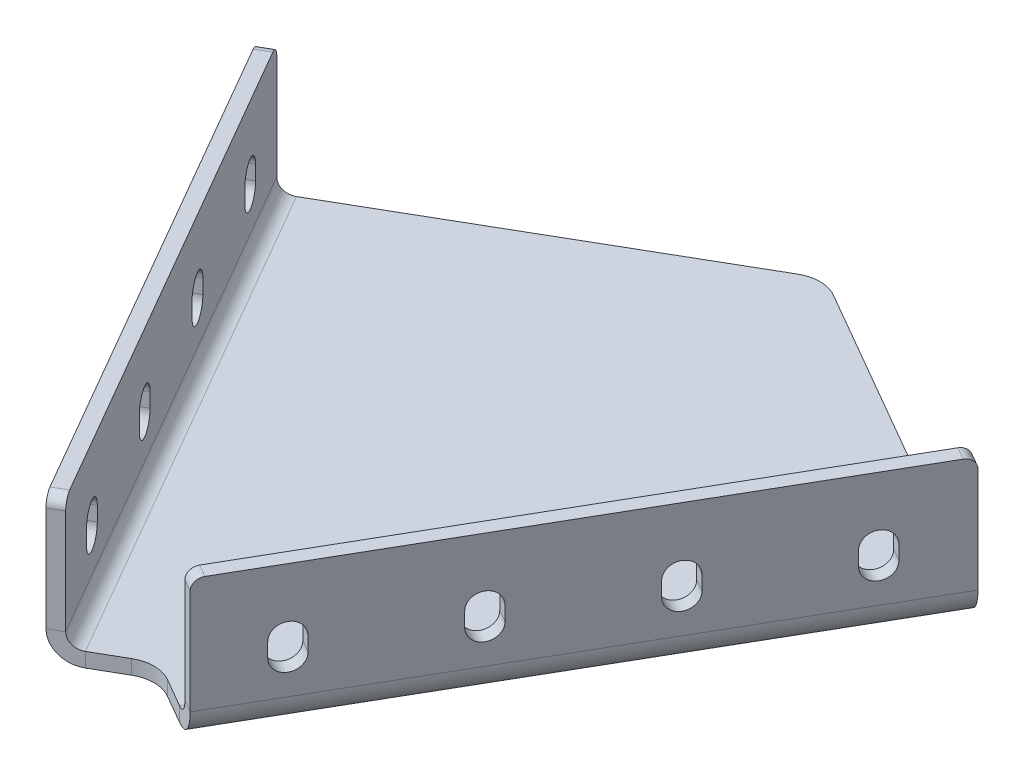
ISO-10303-21;
HEADER;
FILE_DESCRIPTION(('STEP AP214'),'2;1');
FILE_NAME('part.step','',(''),(''),'','','');
FILE_SCHEMA(('AUTOMOTIVE_DESIGN { 1 0 10303 214 1 1 1 1 }'));
ENDSEC;
DATA;
#1=APPLICATION_CONTEXT('core data for automotive mechanical design processes');
#2=APPLICATION_PROTOCOL_DEFINITION('international standard','automotive_design',2000,#1);
#3=PRODUCT_CONTEXT('',#1,'mechanical');
#4=PRODUCT('Part','Part','',(#3));
#5=PRODUCT_RELATED_PRODUCT_CATEGORY('part','',(#4));
#6=PRODUCT_DEFINITION_FORMATION('','',#4);
#7=PRODUCT_DEFINITION_CONTEXT('part definition',#1,'design');
#8=PRODUCT_DEFINITION('design','',#6,#7);
#9=PRODUCT_DEFINITION_SHAPE('','',#8);
#10=(LENGTH_UNIT() NAMED_UNIT(*) SI_UNIT(.MILLI.,.METRE.));
#11=(NAMED_UNIT(*) PLANE_ANGLE_UNIT() SI_UNIT($,.RADIAN.));
#12=(NAMED_UNIT(*) SI_UNIT($,.STERADIAN.) SOLID_ANGLE_UNIT());
#13=UNCERTAINTY_MEASURE_WITH_UNIT(LENGTH_MEASURE(1.E-05),#10,'distance_accuracy_value','');
#14=(GEOMETRIC_REPRESENTATION_CONTEXT(3) GLOBAL_UNCERTAINTY_ASSIGNED_CONTEXT((#13)) GLOBAL_UNIT_ASSIGNED_CONTEXT((#10,
#11,#12)) REPRESENTATION_CONTEXT('',''));
#15=CARTESIAN_POINT('',(0.,0.,0.));
#16=DIRECTION('',(0.,0.,1.));
#17=DIRECTION('',(1.,0.,0.));
#18=AXIS2_PLACEMENT_3D('',#15,#16,#17);
#19=CARTESIAN_POINT('',(0.,-4.,0.));
#20=DIRECTION('',(0.,1.,0.));
#21=DIRECTION('',(0.,0.,1.));
#22=AXIS2_PLACEMENT_3D('',#19,#20,#21);
#23=PLANE('',#22);
#24=DIRECTION('',(-0.866025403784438,0.,0.500000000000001));
#25=VECTOR('',#24,1.);
#26=CARTESIAN_POINT('',(-96.5340966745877,-4.,-129.016013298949));
#27=LINE('',#26,#25);
#28=CARTESIAN_POINT('',(-5.,-4.,-181.863248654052));
#29=VERTEX_POINT('',#28);
#30=CARTESIAN_POINT('',(-93.0699950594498,-4.,-131.016013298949));
#31=VERTEX_POINT('',#30);
#32=EDGE_CURVE('E741',#29,#31,#27,.T.);
#33=ORIENTED_EDGE('',*,*,#32,.F.);
#34=CARTESIAN_POINT('',(0.,-4.,-173.202994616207));
#35=DIRECTION('',(0.,1.,0.));
#36=DIRECTION('',(0.,0.,1.));
#37=AXIS2_PLACEMENT_3D('',#34,#35,#36);
#38=CIRCLE('',#37,10.);
#39=CARTESIAN_POINT('',(4.99999999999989,-4.,-181.863248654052));
#40=VERTEX_POINT('',#39);
#41=EDGE_CURVE('E758',#29,#40,#38,.F.);
#42=ORIENTED_EDGE('',*,*,#41,.T.);
#43=DIRECTION('',(-0.866025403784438,0.,-0.500000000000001));
#44=VECTOR('',#43,1.);
#45=CARTESIAN_POINT('',(96.5340966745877,-4.,-129.016013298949));
#46=LINE('',#45,#44);
#47=CARTESIAN_POINT('',(93.0699950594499,-4.,-131.016013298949));
#48=VERTEX_POINT('',#47);
#49=EDGE_CURVE('E738',#48,#40,#46,.T.);
#50=ORIENTED_EDGE('',*,*,#49,.F.);
#51=DIRECTION('',(0.500000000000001,0.,-0.866025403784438));
#52=VECTOR('',#51,1.);
#53=CARTESIAN_POINT('',(93.0699950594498,-4.,-131.016013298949));
#54=LINE('',#53,#52);
#55=CARTESIAN_POINT('',(13.0708983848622,-4.,7.54648670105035));
#56=VERTEX_POINT('',#55);
#57=EDGE_CURVE('E657',#48,#56,#54,.F.);
#58=ORIENTED_EDGE('',*,*,#57,.T.);
#59=DIRECTION('',(0.86602540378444,0.,0.499999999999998));
#60=VECTOR('',#59,1.);
#61=CARTESIAN_POINT('',(16.535,-4.,9.54648670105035));
#62=LINE('',#61,#60);
#63=CARTESIAN_POINT('',(5.,-4.,2.88675134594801));
#64=VERTEX_POINT('',#63);
#65=EDGE_CURVE('E735',#64,#56,#62,.T.);
#66=ORIENTED_EDGE('',*,*,#65,.F.);
#67=CARTESIAN_POINT('',(0.,-4.,11.5470053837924));
#68=DIRECTION('',(0.,1.,0.));
#69=DIRECTION('',(0.,0.,1.));
#70=AXIS2_PLACEMENT_3D('',#67,#68,#69);
#71=CIRCLE('',#70,10.);
#72=CARTESIAN_POINT('',(-5.,-4.,2.88675134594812));
#73=VERTEX_POINT('',#72);
#74=EDGE_CURVE('E767',#64,#73,#71,.T.);
#75=ORIENTED_EDGE('',*,*,#74,.T.);
#76=DIRECTION('',(0.86602540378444,0.,-0.499999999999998));
#77=VECTOR('',#76,1.);
#78=CARTESIAN_POINT('',(-16.5350000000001,-4.,9.54648670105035));
#79=LINE('',#78,#77);
#80=CARTESIAN_POINT('',(-13.0708983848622,-4.,7.54648670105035));
#81=VERTEX_POINT('',#80);
#82=EDGE_CURVE('E732',#81,#73,#79,.T.);
#83=ORIENTED_EDGE('',*,*,#82,.F.);
#84=DIRECTION('',(0.500000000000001,0.,0.866025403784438));
#85=VECTOR('',#84,1.);
#86=CARTESIAN_POINT('',(-13.0708983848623,-4.,7.54648670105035));
#87=LINE('',#86,#85);
#88=EDGE_CURVE('E708',#81,#31,#87,.F.);
#89=ORIENTED_EDGE('',*,*,#88,.T.);
#90=EDGE_LOOP('',(#33,#42,#50,#58,#66,#75,#83,#89));
#91=FACE_BOUND('',#90,.T.);
#92=ADVANCED_FACE('F40',(#91),#23,.F.);
#93=CARTESIAN_POINT('',(0.,0.,0.));
#94=DIRECTION('',(0.,1.,0.));
#95=DIRECTION('',(0.,0.,1.));
#96=AXIS2_PLACEMENT_3D('',#93,#94,#95);
#97=PLANE('',#96);
#98=DIRECTION('',(-0.866025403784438,0.,-0.500000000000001));
#99=VECTOR('',#98,1.);
#100=CARTESIAN_POINT('',(96.5340966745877,0.,-129.016013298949));
#101=LINE('',#100,#99);
#102=CARTESIAN_POINT('',(93.0699950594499,0.,-131.016013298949));
#103=VERTEX_POINT('',#102);
#104=CARTESIAN_POINT('',(4.99999999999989,0.,-181.863248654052));
#105=VERTEX_POINT('',#104);
#106=EDGE_CURVE('E748',#103,#105,#101,.T.);
#107=ORIENTED_EDGE('',*,*,#106,.T.);
#108=CARTESIAN_POINT('',(0.,0.,-173.202994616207));
#109=DIRECTION('',(0.,1.,0.));
#110=DIRECTION('',(0.,0.,1.));
#111=AXIS2_PLACEMENT_3D('',#108,#109,#110);
#112=CIRCLE('',#111,10.);
#113=CARTESIAN_POINT('',(-5.,0.,-181.863248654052));
#114=VERTEX_POINT('',#113);
#115=EDGE_CURVE('E754',#105,#114,#112,.T.);
#116=ORIENTED_EDGE('',*,*,#115,.T.);
#117=DIRECTION('',(-0.866025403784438,0.,0.500000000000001));
#118=VECTOR('',#117,1.);
#119=CARTESIAN_POINT('',(-96.5340966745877,0.,-129.016013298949));
#120=LINE('',#119,#118);
#121=CARTESIAN_POINT('',(-93.0699950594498,0.,-131.016013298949));
#122=VERTEX_POINT('',#121);
#123=EDGE_CURVE('E736',#114,#122,#120,.T.);
#124=ORIENTED_EDGE('',*,*,#123,.T.);
#125=DIRECTION('',(0.500000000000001,0.,0.866025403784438));
#126=VECTOR('',#125,1.);
#127=CARTESIAN_POINT('',(-13.0708983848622,0.,7.54648670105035));
#128=LINE('',#127,#126);
#129=CARTESIAN_POINT('',(-13.0708983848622,0.,7.54648670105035));
#130=VERTEX_POINT('',#129);
#131=EDGE_CURVE('E721',#130,#122,#128,.F.);
#132=ORIENTED_EDGE('',*,*,#131,.F.);
#133=DIRECTION('',(0.86602540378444,0.,-0.499999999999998));
#134=VECTOR('',#133,1.);
#135=CARTESIAN_POINT('',(-16.5350000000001,0.,9.54648670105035));
#136=LINE('',#135,#134);
#137=CARTESIAN_POINT('',(-5.,0.,2.88675134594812));
#138=VERTEX_POINT('',#137);
#139=EDGE_CURVE('E729',#130,#138,#136,.T.);
#140=ORIENTED_EDGE('',*,*,#139,.T.);
#141=CARTESIAN_POINT('',(0.,0.,11.5470053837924));
#142=DIRECTION('',(0.,1.,0.));
#143=DIRECTION('',(0.,0.,1.));
#144=AXIS2_PLACEMENT_3D('',#141,#142,#143);
#145=CIRCLE('',#144,10.);
#146=CARTESIAN_POINT('',(5.,0.,2.88675134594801));
#147=VERTEX_POINT('',#146);
#148=EDGE_CURVE('E765',#138,#147,#145,.F.);
#149=ORIENTED_EDGE('',*,*,#148,.T.);
#150=DIRECTION('',(0.86602540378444,0.,0.499999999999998));
#151=VECTOR('',#150,1.);
#152=CARTESIAN_POINT('',(16.535,0.,9.54648670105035));
#153=LINE('',#152,#151);
#154=CARTESIAN_POINT('',(13.0708983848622,0.,7.54648670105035));
#155=VERTEX_POINT('',#154);
#156=EDGE_CURVE('E746',#147,#155,#153,.T.);
#157=ORIENTED_EDGE('',*,*,#156,.T.);
#158=DIRECTION('',(0.500000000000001,0.,-0.866025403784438));
#159=VECTOR('',#158,1.);
#160=CARTESIAN_POINT('',(93.0699950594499,0.,-131.016013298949));
#161=LINE('',#160,#159);
#162=EDGE_CURVE('E670',#103,#155,#161,.F.);
#163=ORIENTED_EDGE('',*,*,#162,.F.);
#164=EDGE_LOOP('',(#107,#116,#124,#132,#140,#149,#157,#163));
#165=FACE_BOUND('',#164,.T.);
#166=ADVANCED_FACE('F846',(#165),#97,.T.);
#167=CARTESIAN_POINT('',(96.5340966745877,-4.,-129.016013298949));
#168=DIRECTION('',(0.500000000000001,0.,-0.866025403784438));
#169=DIRECTION('',(-0.866025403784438,0.,-0.500000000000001));
#170=AXIS2_PLACEMENT_3D('',#167,#168,#169);
#171=PLANE('',#170);
#172=ORIENTED_EDGE('',*,*,#49,.T.);
#173=DIRECTION('',(0.,1.,0.));
#174=VECTOR('',#173,1.);
#175=CARTESIAN_POINT('',(4.99999999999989,-4.,-181.863248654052));
#176=LINE('',#175,#174);
#177=EDGE_CURVE('E743',#40,#105,#176,.T.);
#178=ORIENTED_EDGE('',*,*,#177,.T.);
#179=ORIENTED_EDGE('',*,*,#106,.F.);
#180=DIRECTION('',(0.,-1.,0.));
#181=VECTOR('',#180,1.);
#182=CARTESIAN_POINT('',(93.0699950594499,0.,-131.016013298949));
#183=LINE('',#182,#181);
#184=EDGE_CURVE('E664',#103,#48,#183,.T.);
#185=ORIENTED_EDGE('',*,*,#184,.T.);
#186=EDGE_LOOP('',(#172,#178,#179,#185));
#187=FACE_BOUND('',#186,.T.);
#188=ADVANCED_FACE('F852',(#187),#171,.T.);
#189=CARTESIAN_POINT('',(-16.5350000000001,-4.,9.54648670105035));
#190=DIRECTION('',(0.499999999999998,0.,0.86602540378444));
#191=DIRECTION('',(0.86602540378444,0.,-0.499999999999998));
#192=AXIS2_PLACEMENT_3D('',#189,#190,#191);
#193=PLANE('',#192);
#194=ORIENTED_EDGE('',*,*,#82,.T.);
#195=DIRECTION('',(0.,1.,0.));
#196=VECTOR('',#195,1.);
#197=CARTESIAN_POINT('',(-5.,0.,2.88675134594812));
#198=LINE('',#197,#196);
#199=EDGE_CURVE('E760',#73,#138,#198,.T.);
#200=ORIENTED_EDGE('',*,*,#199,.T.);
#201=ORIENTED_EDGE('',*,*,#139,.F.);
#202=DIRECTION('',(0.,-1.,0.));
#203=VECTOR('',#202,1.);
#204=CARTESIAN_POINT('',(-13.0708983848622,0.,7.54648670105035));
#205=LINE('',#204,#203);
#206=EDGE_CURVE('E715',#130,#81,#205,.T.);
#207=ORIENTED_EDGE('',*,*,#206,.T.);
#208=EDGE_LOOP('',(#194,#200,#201,#207));
#209=FACE_BOUND('',#208,.T.);
#210=ADVANCED_FACE('F864',(#209),#193,.T.);
#211=CARTESIAN_POINT('',(-96.5340966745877,-4.,-129.016013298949));
#212=DIRECTION('',(-0.500000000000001,0.,-0.866025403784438));
#213=DIRECTION('',(-0.866025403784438,0.,0.500000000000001));
#214=AXIS2_PLACEMENT_3D('',#211,#212,#213);
#215=PLANE('',#214);
#216=ORIENTED_EDGE('',*,*,#123,.F.);
#217=DIRECTION('',(0.,1.,0.));
#218=VECTOR('',#217,1.);
#219=CARTESIAN_POINT('',(-5.00000000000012,-4.,-181.863248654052));
#220=LINE('',#219,#218);
#221=EDGE_CURVE('E756',#114,#29,#220,.F.);
#222=ORIENTED_EDGE('',*,*,#221,.T.);
#223=ORIENTED_EDGE('',*,*,#32,.T.);
#224=DIRECTION('',(0.,-1.,0.));
#225=VECTOR('',#224,1.);
#226=CARTESIAN_POINT('',(-93.0699950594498,0.,-131.016013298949));
#227=LINE('',#226,#225);
#228=EDGE_CURVE('E726',#122,#31,#227,.T.);
#229=ORIENTED_EDGE('',*,*,#228,.F.);
#230=EDGE_LOOP('',(#216,#222,#223,#229));
#231=FACE_BOUND('',#230,.T.);
#232=ADVANCED_FACE('F860',(#231),#215,.T.);
#233=CARTESIAN_POINT('',(16.535,-4.,9.54648670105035));
#234=DIRECTION('',(-0.499999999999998,0.,0.86602540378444));
#235=DIRECTION('',(0.86602540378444,0.,0.499999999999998));
#236=AXIS2_PLACEMENT_3D('',#233,#234,#235);
#237=PLANE('',#236);
#238=ORIENTED_EDGE('',*,*,#156,.F.);
#239=DIRECTION('',(0.,1.,0.));
#240=VECTOR('',#239,1.);
#241=CARTESIAN_POINT('',(5.,-4.,2.88675134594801));
#242=LINE('',#241,#240);
#243=EDGE_CURVE('E763',#147,#64,#242,.F.);
#244=ORIENTED_EDGE('',*,*,#243,.T.);
#245=ORIENTED_EDGE('',*,*,#65,.T.);
#246=DIRECTION('',(0.,-1.,0.));
#247=VECTOR('',#246,1.);
#248=CARTESIAN_POINT('',(13.0708983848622,0.,7.54648670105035));
#249=LINE('',#248,#247);
#250=EDGE_CURVE('E675',#155,#56,#249,.T.);
#251=ORIENTED_EDGE('',*,*,#250,.F.);
#252=EDGE_LOOP('',(#238,#244,#245,#251));
#253=FACE_BOUND('',#252,.T.);
#254=ADVANCED_FACE('F863',(#253),#237,.T.);
#255=CARTESIAN_POINT('',(-93.0699950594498,4.,-131.016013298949));
#256=DIRECTION('',(-0.500000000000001,0.,-0.866025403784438));
#257=DIRECTION('',(-0.866025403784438,0.,0.500000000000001));
#258=AXIS2_PLACEMENT_3D('',#255,#256,#257);
#259=PLANE('',#258);
#260=DIRECTION('',(-0.866025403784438,0.,0.500000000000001));
#261=VECTOR('',#260,1.);
#262=CARTESIAN_POINT('',(-96.5340966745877,4.,-129.016013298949));
#263=LINE('',#262,#261);
#264=CARTESIAN_POINT('',(-96.5340966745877,4.,-129.016013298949));
#265=VERTEX_POINT('',#264);
#266=CARTESIAN_POINT('',(-99.9981982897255,3.99999999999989,-127.016013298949));
#267=VERTEX_POINT('',#266);
#268=EDGE_CURVE('E678',#265,#267,#263,.T.);
#269=ORIENTED_EDGE('',*,*,#268,.F.);
#270=CARTESIAN_POINT('',(-93.0699950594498,4.,-131.016013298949));
#271=DIRECTION('',(0.500000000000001,0.,0.866025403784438));
#272=DIRECTION('',(0.866025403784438,0.,-0.500000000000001));
#273=AXIS2_PLACEMENT_3D('',#270,#271,#272);
#274=CIRCLE('',#273,4.00000000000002);
#275=EDGE_CURVE('E718',#122,#265,#274,.F.);
#276=ORIENTED_EDGE('',*,*,#275,.F.);
#277=ORIENTED_EDGE('',*,*,#228,.T.);
#278=CARTESIAN_POINT('',(-93.0699950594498,4.,-131.016013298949));
#279=DIRECTION('',(0.500000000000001,0.,0.866025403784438));
#280=DIRECTION('',(0.866025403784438,0.,-0.500000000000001));
#281=AXIS2_PLACEMENT_3D('',#278,#279,#280);
#282=CIRCLE('',#281,8.00000000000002);
#283=EDGE_CURVE('E711',#31,#267,#282,.F.);
#284=ORIENTED_EDGE('',*,*,#283,.T.);
#285=EDGE_LOOP('',(#269,#276,#277,#284));
#286=FACE_BOUND('',#285,.T.);
#287=ADVANCED_FACE('F871',(#286),#259,.T.);
#288=CARTESIAN_POINT('',(-13.0708983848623,4.,7.54648670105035));
#289=DIRECTION('',(-0.500000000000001,0.,-0.866025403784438));
#290=DIRECTION('',(-0.866025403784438,0.,0.500000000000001));
#291=AXIS2_PLACEMENT_3D('',#288,#289,#290);
#292=PLANE('',#291);
#293=CARTESIAN_POINT('',(-13.0708983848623,4.,7.54648670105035));
#294=DIRECTION('',(0.500000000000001,0.,0.866025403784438));
#295=DIRECTION('',(0.866025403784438,0.,-0.500000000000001));
#296=AXIS2_PLACEMENT_3D('',#293,#294,#295);
#297=CIRCLE('',#296,4.00000000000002);
#298=CARTESIAN_POINT('',(-16.5350000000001,4.,9.54648670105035));
#299=VERTEX_POINT('',#298);
#300=EDGE_CURVE('E701',#299,#130,#297,.T.);
#301=ORIENTED_EDGE('',*,*,#300,.F.);
#302=DIRECTION('',(-0.866025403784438,0.,0.500000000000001));
#303=VECTOR('',#302,1.);
#304=CARTESIAN_POINT('',(-16.535,4.,9.54648670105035));
#305=LINE('',#304,#303);
#306=CARTESIAN_POINT('',(-19.9991016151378,4.,11.5464867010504));
#307=VERTEX_POINT('',#306);
#308=EDGE_CURVE('E683',#299,#307,#305,.T.);
#309=ORIENTED_EDGE('',*,*,#308,.T.);
#310=CARTESIAN_POINT('',(-13.0708983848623,4.,7.54648670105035));
#311=DIRECTION('',(0.500000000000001,0.,0.866025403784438));
#312=DIRECTION('',(0.866025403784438,0.,-0.500000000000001));
#313=AXIS2_PLACEMENT_3D('',#310,#311,#312);
#314=CIRCLE('',#313,8.00000000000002);
#315=EDGE_CURVE('E712',#307,#81,#314,.T.);
#316=ORIENTED_EDGE('',*,*,#315,.T.);
#317=ORIENTED_EDGE('',*,*,#206,.F.);
#318=EDGE_LOOP('',(#301,#309,#316,#317));
#319=FACE_BOUND('',#318,.T.);
#320=ADVANCED_FACE('F857',(#319),#292,.F.);
#321=CARTESIAN_POINT('',(-13.0708983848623,4.,7.54648670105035));
#322=DIRECTION('',(0.500000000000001,0.,0.866025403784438));
#323=DIRECTION('',(-0.866025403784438,0.,0.500000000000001));
#324=AXIS2_PLACEMENT_3D('',#321,#322,#323);
#325=CYLINDRICAL_SURFACE('',#324,8.00000000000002);
#326=ORIENTED_EDGE('',*,*,#88,.F.);
#327=ORIENTED_EDGE('',*,*,#315,.F.);
#328=DIRECTION('',(-0.500000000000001,0.,-0.866025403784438));
#329=VECTOR('',#328,1.);
#330=CARTESIAN_POINT('',(-19.9991016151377,4.,11.5464867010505));
#331=LINE('',#330,#329);
#332=EDGE_CURVE('E686',#307,#267,#331,.T.);
#333=ORIENTED_EDGE('',*,*,#332,.T.);
#334=ORIENTED_EDGE('',*,*,#283,.F.);
#335=EDGE_LOOP('',(#326,#327,#333,#334));
#336=FACE_BOUND('',#335,.T.);
#337=ADVANCED_FACE('F935',(#336),#325,.T.);
#338=CARTESIAN_POINT('',(-13.0708983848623,4.,7.54648670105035));
#339=DIRECTION('',(0.500000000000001,0.,0.866025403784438));
#340=DIRECTION('',(-0.866025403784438,0.,0.500000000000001));
#341=AXIS2_PLACEMENT_3D('',#338,#339,#340);
#342=CYLINDRICAL_SURFACE('',#341,4.00000000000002);
#343=ORIENTED_EDGE('',*,*,#131,.T.);
#344=ORIENTED_EDGE('',*,*,#275,.T.);
#345=DIRECTION('',(0.500000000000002,0.,0.866025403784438));
#346=VECTOR('',#345,1.);
#347=CARTESIAN_POINT('',(-96.5340966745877,4.,-129.016013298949));
#348=LINE('',#347,#346);
#349=EDGE_CURVE('E681',#265,#299,#348,.T.);
#350=ORIENTED_EDGE('',*,*,#349,.T.);
#351=ORIENTED_EDGE('',*,*,#300,.T.);
#352=EDGE_LOOP('',(#343,#344,#350,#351));
#353=FACE_BOUND('',#352,.T.);
#354=ADVANCED_FACE('F905',(#353),#342,.F.);
#355=CARTESIAN_POINT('',(-19.999101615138,36.,11.5464867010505));
#356=DIRECTION('',(-0.500000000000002,0.,-0.866025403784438));
#357=DIRECTION('',(-0.866025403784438,0.,0.500000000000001));
#358=AXIS2_PLACEMENT_3D('',#355,#356,#357);
#359=PLANE('',#358);
#360=DIRECTION('',(0.,1.,0.));
#361=VECTOR('',#360,1.);
#362=CARTESIAN_POINT('',(-16.5350000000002,36.,9.54648670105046));
#363=LINE('',#362,#361);
#364=CARTESIAN_POINT('',(-16.5350000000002,33.,9.54648670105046));
#365=VERTEX_POINT('',#364);
#366=EDGE_CURVE('E691',#299,#365,#363,.T.);
#367=ORIENTED_EDGE('',*,*,#366,.T.);
#368=DIRECTION('',(0.866025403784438,0.,-0.500000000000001));
#369=VECTOR('',#368,1.);
#370=CARTESIAN_POINT('',(-19.999101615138,33.,11.5464867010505));
#371=LINE('',#370,#369);
#372=CARTESIAN_POINT('',(-19.999101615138,33.,11.5464867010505));
#373=VERTEX_POINT('',#372);
#374=EDGE_CURVE('E11',#365,#373,#371,.F.);
#375=ORIENTED_EDGE('',*,*,#374,.T.);
#376=DIRECTION('',(0.,1.,0.));
#377=VECTOR('',#376,1.);
#378=CARTESIAN_POINT('',(-19.999101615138,36.,11.5464867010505));
#379=LINE('',#378,#377);
#380=EDGE_CURVE('E692',#307,#373,#379,.T.);
#381=ORIENTED_EDGE('',*,*,#380,.F.);
#382=ORIENTED_EDGE('',*,*,#308,.F.);
#383=EDGE_LOOP('',(#367,#375,#381,#382));
#384=FACE_BOUND('',#383,.T.);
#385=ADVANCED_FACE('F914',(#384),#359,.F.);
#386=CARTESIAN_POINT('',(-99.9981982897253,-1.11022302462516E-13,-127.016013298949));
#387=DIRECTION('',(0.500000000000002,0.,0.866025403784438));
#388=DIRECTION('',(0.866025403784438,0.,-0.500000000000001));
#389=AXIS2_PLACEMENT_3D('',#386,#387,#388);
#390=PLANE('',#389);
#391=DIRECTION('',(0.,-1.,0.));
#392=VECTOR('',#391,1.);
#393=CARTESIAN_POINT('',(-99.9981982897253,-1.11022302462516E-13,-127.016013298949));
#394=LINE('',#393,#392);
#395=CARTESIAN_POINT('',(-99.9981982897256,32.9999999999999,-127.016013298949));
#396=VERTEX_POINT('',#395);
#397=EDGE_CURVE('E699',#396,#267,#394,.T.);
#398=ORIENTED_EDGE('',*,*,#397,.F.);
#399=DIRECTION('',(0.866025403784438,0.,-0.500000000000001));
#400=VECTOR('',#399,1.);
#401=CARTESIAN_POINT('',(-99.9981982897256,32.9999999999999,-127.016013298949));
#402=LINE('',#401,#400);
#403=CARTESIAN_POINT('',(-96.5340966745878,32.9999999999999,-129.016013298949));
#404=VERTEX_POINT('',#403);
#405=EDGE_CURVE('E769',#396,#404,#402,.T.);
#406=ORIENTED_EDGE('',*,*,#405,.T.);
#407=DIRECTION('',(0.,-1.,0.));
#408=VECTOR('',#407,1.);
#409=CARTESIAN_POINT('',(-96.5340966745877,0.,-129.016013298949));
#410=LINE('',#409,#408);
#411=EDGE_CURVE('E696',#404,#265,#410,.T.);
#412=ORIENTED_EDGE('',*,*,#411,.T.);
#413=ORIENTED_EDGE('',*,*,#268,.T.);
#414=EDGE_LOOP('',(#398,#406,#412,#413));
#415=FACE_BOUND('',#414,.T.);
#416=ADVANCED_FACE('F897',(#415),#390,.F.);
#417=CARTESIAN_POINT('',(-19.9991016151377,-1.11022302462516E-13,11.5464867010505));
#418=DIRECTION('',(0.866025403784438,0.,-0.500000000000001));
#419=DIRECTION('',(-0.500000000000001,0.,-0.866025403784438));
#420=AXIS2_PLACEMENT_3D('',#417,#418,#419);
#421=PLANE('',#420);
#422=DIRECTION('',(0.,-1.,0.));
#423=VECTOR('',#422,1.);
#424=CARTESIAN_POINT('',(-31.9741016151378,17.9999999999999,-9.19482171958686));
#425=LINE('',#424,#423);
#426=CARTESIAN_POINT('',(-31.9741016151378,17.9999999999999,-9.19482171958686));
#427=VERTEX_POINT('',#426);
#428=CARTESIAN_POINT('',(-31.9741016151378,13.9999999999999,-9.19482171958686));
#429=VERTEX_POINT('',#428);
#430=EDGE_CURVE('E518',#427,#429,#425,.T.);
#431=ORIENTED_EDGE('',*,*,#430,.F.);
#432=CARTESIAN_POINT('',(-29.9241016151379,17.9999999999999,-5.64411756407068));
#433=DIRECTION('',(-0.866025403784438,0.,0.500000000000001));
#434=DIRECTION('',(0.500000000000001,0.,0.866025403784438));
#435=AXIS2_PLACEMENT_3D('',#432,#433,#434);
#436=CIRCLE('',#435,4.1);
#437=CARTESIAN_POINT('',(-27.8741016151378,17.9999999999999,-2.0934134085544));
#438=VERTEX_POINT('',#437);
#439=EDGE_CURVE('E516',#438,#427,#436,.T.);
#440=ORIENTED_EDGE('',*,*,#439,.F.);
#441=DIRECTION('',(0.,1.,0.));
#442=VECTOR('',#441,1.);
#443=CARTESIAN_POINT('',(-27.8741016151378,17.9999999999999,-2.0934134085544));
#444=LINE('',#443,#442);
#445=CARTESIAN_POINT('',(-27.8741016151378,13.9999999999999,-2.0934134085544));
#446=VERTEX_POINT('',#445);
#447=EDGE_CURVE('E506',#446,#438,#444,.T.);
#448=ORIENTED_EDGE('',*,*,#447,.F.);
#449=CARTESIAN_POINT('',(-29.9241016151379,13.9999999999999,-5.64411756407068));
#450=DIRECTION('',(-0.866025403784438,0.,0.500000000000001));
#451=DIRECTION('',(0.500000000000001,0.,0.866025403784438));
#452=AXIS2_PLACEMENT_3D('',#449,#450,#451);
#453=CIRCLE('',#452,4.1);
#454=EDGE_CURVE('E522',#429,#446,#453,.T.);
#455=ORIENTED_EDGE('',*,*,#454,.F.);
#456=EDGE_LOOP('',(#431,#440,#448,#455));
#457=FACE_BOUND('',#456,.T.);
#458=DIRECTION('',(0.,-1.,0.));
#459=VECTOR('',#458,1.);
#460=CARTESIAN_POINT('',(-51.9741016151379,17.9999999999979,-43.8358378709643));
#461=LINE('',#460,#459);
#462=CARTESIAN_POINT('',(-51.9741016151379,17.9999999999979,-43.8358378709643));
#463=VERTEX_POINT('',#462);
#464=CARTESIAN_POINT('',(-51.9741016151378,13.9999999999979,-43.8358378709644));
#465=VERTEX_POINT('',#464);
#466=EDGE_CURVE('E552',#463,#465,#461,.T.);
#467=ORIENTED_EDGE('',*,*,#466,.F.);
#468=CARTESIAN_POINT('',(-49.9241016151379,17.9999999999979,-40.2851337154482));
#469=DIRECTION('',(-0.866025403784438,0.,0.500000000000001));
#470=DIRECTION('',(0.500000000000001,0.,0.866025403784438));
#471=AXIS2_PLACEMENT_3D('',#468,#469,#470);
#472=CIRCLE('',#471,4.10000000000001);
#473=CARTESIAN_POINT('',(-47.8741016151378,17.9999999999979,-36.7344295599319));
#474=VERTEX_POINT('',#473);
#475=EDGE_CURVE('E550',#474,#463,#472,.T.);
#476=ORIENTED_EDGE('',*,*,#475,.F.);
#477=DIRECTION('',(0.,1.,0.));
#478=VECTOR('',#477,1.);
#479=CARTESIAN_POINT('',(-47.8741016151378,17.9999999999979,-36.7344295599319));
#480=LINE('',#479,#478);
#481=CARTESIAN_POINT('',(-47.8741016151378,13.9999999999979,-36.7344295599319));
#482=VERTEX_POINT('',#481);
#483=EDGE_CURVE('E540',#482,#474,#480,.T.);
#484=ORIENTED_EDGE('',*,*,#483,.F.);
#485=CARTESIAN_POINT('',(-49.9241016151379,13.9999999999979,-40.2851337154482));
#486=DIRECTION('',(-0.866025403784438,0.,0.500000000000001));
#487=DIRECTION('',(0.500000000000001,0.,0.866025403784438));
#488=AXIS2_PLACEMENT_3D('',#485,#486,#487);
#489=CIRCLE('',#488,4.10000000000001);
#490=EDGE_CURVE('E556',#465,#482,#489,.T.);
#491=ORIENTED_EDGE('',*,*,#490,.F.);
#492=EDGE_LOOP('',(#467,#476,#484,#491));
#493=FACE_BOUND('',#492,.T.);
#494=DIRECTION('',(0.,-1.,0.));
#495=VECTOR('',#494,1.);
#496=CARTESIAN_POINT('',(-71.974101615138,17.9999999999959,-78.4768540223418));
#497=LINE('',#496,#495);
#498=CARTESIAN_POINT('',(-71.974101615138,17.9999999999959,-78.4768540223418));
#499=VERTEX_POINT('',#498);
#500=CARTESIAN_POINT('',(-71.9741016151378,13.9999999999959,-78.4768540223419));
#501=VERTEX_POINT('',#500);
#502=EDGE_CURVE('E584',#499,#501,#497,.T.);
#503=ORIENTED_EDGE('',*,*,#502,.F.);
#504=CARTESIAN_POINT('',(-69.924101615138,17.9999999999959,-74.9261498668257));
#505=DIRECTION('',(-0.866025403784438,0.,0.500000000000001));
#506=DIRECTION('',(0.500000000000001,0.,0.866025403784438));
#507=AXIS2_PLACEMENT_3D('',#504,#505,#506);
#508=CIRCLE('',#507,4.09999999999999);
#509=CARTESIAN_POINT('',(-67.8741016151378,17.9999999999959,-71.3754457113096));
#510=VERTEX_POINT('',#509);
#511=EDGE_CURVE('E582',#510,#499,#508,.T.);
#512=ORIENTED_EDGE('',*,*,#511,.F.);
#513=DIRECTION('',(0.,1.,0.));
#514=VECTOR('',#513,1.);
#515=CARTESIAN_POINT('',(-67.8741016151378,17.9999999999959,-71.3754457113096));
#516=LINE('',#515,#514);
#517=CARTESIAN_POINT('',(-67.8741016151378,13.9999999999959,-71.3754457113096));
#518=VERTEX_POINT('',#517);
#519=EDGE_CURVE('E572',#518,#510,#516,.T.);
#520=ORIENTED_EDGE('',*,*,#519,.F.);
#521=CARTESIAN_POINT('',(-69.924101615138,13.9999999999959,-74.9261498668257));
#522=DIRECTION('',(-0.866025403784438,0.,0.500000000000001));
#523=DIRECTION('',(0.500000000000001,0.,0.866025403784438));
#524=AXIS2_PLACEMENT_3D('',#521,#522,#523);
#525=CIRCLE('',#524,4.09999999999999);
#526=EDGE_CURVE('E588',#501,#518,#525,.T.);
#527=ORIENTED_EDGE('',*,*,#526,.F.);
#528=EDGE_LOOP('',(#503,#512,#520,#527));
#529=FACE_BOUND('',#528,.T.);
#530=DIRECTION('',(0.,-1.,0.));
#531=VECTOR('',#530,1.);
#532=CARTESIAN_POINT('',(-91.9741016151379,17.9999999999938,-113.117870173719));
#533=LINE('',#532,#531);
#534=CARTESIAN_POINT('',(-91.9741016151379,17.9999999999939,-113.117870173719));
#535=VERTEX_POINT('',#534);
#536=CARTESIAN_POINT('',(-91.9741016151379,13.9999999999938,-113.117870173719));
#537=VERTEX_POINT('',#536);
#538=EDGE_CURVE('E615',#535,#537,#533,.T.);
#539=ORIENTED_EDGE('',*,*,#538,.F.);
#540=CARTESIAN_POINT('',(-89.924101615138,17.9999999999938,-109.567166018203));
#541=DIRECTION('',(-0.866025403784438,0.,0.500000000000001));
#542=DIRECTION('',(0.500000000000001,0.,0.866025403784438));
#543=AXIS2_PLACEMENT_3D('',#540,#541,#542);
#544=CIRCLE('',#543,4.09999999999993);
#545=CARTESIAN_POINT('',(-87.8741016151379,17.9999999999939,-106.016461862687));
#546=VERTEX_POINT('',#545);
#547=EDGE_CURVE('E405',#546,#535,#544,.T.);
#548=ORIENTED_EDGE('',*,*,#547,.F.);
#549=DIRECTION('',(0.,1.,0.));
#550=VECTOR('',#549,1.);
#551=CARTESIAN_POINT('',(-87.8741016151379,17.9999999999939,-106.016461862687));
#552=LINE('',#551,#550);
#553=CARTESIAN_POINT('',(-87.8741016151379,13.9999999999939,-106.016461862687));
#554=VERTEX_POINT('',#553);
#555=EDGE_CURVE('E604',#554,#546,#552,.T.);
#556=ORIENTED_EDGE('',*,*,#555,.F.);
#557=CARTESIAN_POINT('',(-89.924101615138,13.9999999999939,-109.567166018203));
#558=DIRECTION('',(-0.866025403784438,0.,0.500000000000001));
#559=DIRECTION('',(0.500000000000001,0.,0.866025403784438));
#560=AXIS2_PLACEMENT_3D('',#557,#558,#559);
#561=CIRCLE('',#560,4.09999999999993);
#562=EDGE_CURVE('E618',#537,#554,#561,.T.);
#563=ORIENTED_EDGE('',*,*,#562,.F.);
#564=EDGE_LOOP('',(#539,#548,#556,#563));
#565=FACE_BOUND('',#564,.T.);
#566=DIRECTION('',(-0.500000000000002,0.,-0.866025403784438));
#567=VECTOR('',#566,1.);
#568=CARTESIAN_POINT('',(-99.9981982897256,35.9999999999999,-127.016013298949));
#569=LINE('',#568,#567);
#570=CARTESIAN_POINT('',(-21.4991016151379,36.,8.94841048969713));
#571=VERTEX_POINT('',#570);
#572=CARTESIAN_POINT('',(-98.4981982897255,35.9999999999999,-124.417937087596));
#573=VERTEX_POINT('',#572);
#574=EDGE_CURVE('E695',#571,#573,#569,.T.);
#575=ORIENTED_EDGE('',*,*,#574,.T.);
#576=CARTESIAN_POINT('',(-98.4981982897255,32.9999999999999,-124.417937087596));
#577=DIRECTION('',(0.866025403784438,0.,-0.500000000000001));
#578=DIRECTION('',(-0.500000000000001,0.,-0.866025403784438));
#579=AXIS2_PLACEMENT_3D('',#576,#577,#578);
#580=CIRCLE('',#579,3.);
#581=EDGE_CURVE('E783',#573,#396,#580,.F.);
#582=ORIENTED_EDGE('',*,*,#581,.T.);
#583=ORIENTED_EDGE('',*,*,#397,.T.);
#584=ORIENTED_EDGE('',*,*,#332,.F.);
#585=ORIENTED_EDGE('',*,*,#380,.T.);
#586=CARTESIAN_POINT('',(-21.4991016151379,33.,8.94841048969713));
#587=DIRECTION('',(0.866025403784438,0.,-0.500000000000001));
#588=DIRECTION('',(-0.500000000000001,0.,-0.866025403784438));
#589=AXIS2_PLACEMENT_3D('',#586,#587,#588);
#590=CIRCLE('',#589,3.);
#591=EDGE_CURVE('E781',#373,#571,#590,.F.);
#592=ORIENTED_EDGE('',*,*,#591,.T.);
#593=EDGE_LOOP('',(#575,#582,#583,#584,#585,#592));
#594=FACE_BOUND('',#593,.T.);
#595=ADVANCED_FACE('F893',(#457,#493,#529,#565,#594),#421,.F.);
#596=CARTESIAN_POINT('',(-16.535,-1.11022302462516E-13,9.54648670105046));
#597=DIRECTION('',(0.866025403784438,0.,-0.500000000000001));
#598=DIRECTION('',(-0.500000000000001,0.,-0.866025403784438));
#599=AXIS2_PLACEMENT_3D('',#596,#597,#598);
#600=PLANE('',#599);
#601=CARTESIAN_POINT('',(-26.4600000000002,17.9999999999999,-7.64411756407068));
#602=DIRECTION('',(-0.866025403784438,0.,0.500000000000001));
#603=DIRECTION('',(0.500000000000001,0.,0.866025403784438));
#604=AXIS2_PLACEMENT_3D('',#601,#602,#603);
#605=CIRCLE('',#604,4.1);
#606=CARTESIAN_POINT('',(-24.41,17.9999999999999,-4.0934134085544));
#607=VERTEX_POINT('',#606);
#608=CARTESIAN_POINT('',(-28.51,17.9999999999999,-11.1948217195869));
#609=VERTEX_POINT('',#608);
#610=EDGE_CURVE('E502',#607,#609,#605,.T.);
#611=ORIENTED_EDGE('',*,*,#610,.T.);
#612=DIRECTION('',(0.,-1.,0.));
#613=VECTOR('',#612,1.);
#614=CARTESIAN_POINT('',(-28.51,17.9999999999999,-11.1948217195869));
#615=LINE('',#614,#613);
#616=CARTESIAN_POINT('',(-28.51,13.9999999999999,-11.1948217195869));
#617=VERTEX_POINT('',#616);
#618=EDGE_CURVE('E505',#609,#617,#615,.T.);
#619=ORIENTED_EDGE('',*,*,#618,.T.);
#620=CARTESIAN_POINT('',(-26.4600000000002,13.9999999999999,-7.64411756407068));
#621=DIRECTION('',(-0.866025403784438,0.,0.500000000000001));
#622=DIRECTION('',(0.500000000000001,0.,0.866025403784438));
#623=AXIS2_PLACEMENT_3D('',#620,#621,#622);
#624=CIRCLE('',#623,4.1);
#625=CARTESIAN_POINT('',(-24.41,13.9999999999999,-4.0934134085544));
#626=VERTEX_POINT('',#625);
#627=EDGE_CURVE('E509',#617,#626,#624,.T.);
#628=ORIENTED_EDGE('',*,*,#627,.T.);
#629=DIRECTION('',(0.,1.,0.));
#630=VECTOR('',#629,1.);
#631=CARTESIAN_POINT('',(-24.41,17.9999999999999,-4.0934134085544));
#632=LINE('',#631,#630);
#633=EDGE_CURVE('E512',#626,#607,#632,.T.);
#634=ORIENTED_EDGE('',*,*,#633,.T.);
#635=EDGE_LOOP('',(#611,#619,#628,#634));
#636=FACE_BOUND('',#635,.T.);
#637=CARTESIAN_POINT('',(-46.4600000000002,17.9999999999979,-42.2851337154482));
#638=DIRECTION('',(-0.866025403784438,0.,0.500000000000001));
#639=DIRECTION('',(0.500000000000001,0.,0.866025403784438));
#640=AXIS2_PLACEMENT_3D('',#637,#638,#639);
#641=CIRCLE('',#640,4.10000000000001);
#642=CARTESIAN_POINT('',(-44.4100000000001,17.9999999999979,-38.7344295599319));
#643=VERTEX_POINT('',#642);
#644=CARTESIAN_POINT('',(-48.5100000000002,17.9999999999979,-45.8358378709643));
#645=VERTEX_POINT('',#644);
#646=EDGE_CURVE('E536',#643,#645,#641,.T.);
#647=ORIENTED_EDGE('',*,*,#646,.T.);
#648=DIRECTION('',(0.,-1.,0.));
#649=VECTOR('',#648,1.);
#650=CARTESIAN_POINT('',(-48.5100000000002,17.9999999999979,-45.8358378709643));
#651=LINE('',#650,#649);
#652=CARTESIAN_POINT('',(-48.5100000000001,13.9999999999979,-45.8358378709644));
#653=VERTEX_POINT('',#652);
#654=EDGE_CURVE('E539',#645,#653,#651,.T.);
#655=ORIENTED_EDGE('',*,*,#654,.T.);
#656=CARTESIAN_POINT('',(-46.4600000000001,13.9999999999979,-42.2851337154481));
#657=DIRECTION('',(-0.866025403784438,0.,0.500000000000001));
#658=DIRECTION('',(0.500000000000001,0.,0.866025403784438));
#659=AXIS2_PLACEMENT_3D('',#656,#657,#658);
#660=CIRCLE('',#659,4.10000000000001);
#661=CARTESIAN_POINT('',(-44.4100000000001,13.9999999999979,-38.7344295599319));
#662=VERTEX_POINT('',#661);
#663=EDGE_CURVE('E543',#653,#662,#660,.T.);
#664=ORIENTED_EDGE('',*,*,#663,.T.);
#665=DIRECTION('',(0.,1.,0.));
#666=VECTOR('',#665,1.);
#667=CARTESIAN_POINT('',(-44.4100000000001,17.9999999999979,-38.7344295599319));
#668=LINE('',#667,#666);
#669=EDGE_CURVE('E546',#662,#643,#668,.T.);
#670=ORIENTED_EDGE('',*,*,#669,.T.);
#671=EDGE_LOOP('',(#647,#655,#664,#670));
#672=FACE_BOUND('',#671,.T.);
#673=CARTESIAN_POINT('',(-66.4600000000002,17.9999999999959,-76.9261498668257));
#674=DIRECTION('',(-0.866025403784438,0.,0.500000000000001));
#675=DIRECTION('',(0.500000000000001,0.,0.866025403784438));
#676=AXIS2_PLACEMENT_3D('',#673,#674,#675);
#677=CIRCLE('',#676,4.09999999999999);
#678=CARTESIAN_POINT('',(-64.4100000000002,17.9999999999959,-73.3754457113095));
#679=VERTEX_POINT('',#678);
#680=CARTESIAN_POINT('',(-68.5100000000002,17.9999999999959,-80.4768540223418));
#681=VERTEX_POINT('',#680);
#682=EDGE_CURVE('E568',#679,#681,#677,.T.);
#683=ORIENTED_EDGE('',*,*,#682,.T.);
#684=DIRECTION('',(0.,-1.,0.));
#685=VECTOR('',#684,1.);
#686=CARTESIAN_POINT('',(-68.5100000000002,17.9999999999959,-80.4768540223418));
#687=LINE('',#686,#685);
#688=CARTESIAN_POINT('',(-68.5100000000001,13.9999999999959,-80.4768540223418));
#689=VERTEX_POINT('',#688);
#690=EDGE_CURVE('E571',#681,#689,#687,.T.);
#691=ORIENTED_EDGE('',*,*,#690,.T.);
#692=CARTESIAN_POINT('',(-66.4600000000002,13.9999999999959,-76.9261498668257));
#693=DIRECTION('',(-0.866025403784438,0.,0.500000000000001));
#694=DIRECTION('',(0.500000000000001,0.,0.866025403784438));
#695=AXIS2_PLACEMENT_3D('',#692,#693,#694);
#696=CIRCLE('',#695,4.09999999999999);
#697=CARTESIAN_POINT('',(-64.4100000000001,13.9999999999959,-73.3754457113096));
#698=VERTEX_POINT('',#697);
#699=EDGE_CURVE('E575',#689,#698,#696,.T.);
#700=ORIENTED_EDGE('',*,*,#699,.T.);
#701=DIRECTION('',(0.,1.,0.));
#702=VECTOR('',#701,1.);
#703=CARTESIAN_POINT('',(-64.4100000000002,17.9999999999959,-73.3754457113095));
#704=LINE('',#703,#702);
#705=EDGE_CURVE('E578',#698,#679,#704,.T.);
#706=ORIENTED_EDGE('',*,*,#705,.T.);
#707=EDGE_LOOP('',(#683,#691,#700,#706));
#708=FACE_BOUND('',#707,.T.);
#709=CARTESIAN_POINT('',(-86.4600000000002,17.9999999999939,-111.567166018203));
#710=DIRECTION('',(-0.866025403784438,0.,0.500000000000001));
#711=DIRECTION('',(0.500000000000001,0.,0.866025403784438));
#712=AXIS2_PLACEMENT_3D('',#709,#710,#711);
#713=CIRCLE('',#712,4.09999999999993);
#714=CARTESIAN_POINT('',(-84.4100000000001,17.9999999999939,-108.016461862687));
#715=VERTEX_POINT('',#714);
#716=CARTESIAN_POINT('',(-88.5100000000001,17.9999999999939,-115.117870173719));
#717=VERTEX_POINT('',#716);
#718=EDGE_CURVE('E600',#715,#717,#713,.T.);
#719=ORIENTED_EDGE('',*,*,#718,.T.);
#720=DIRECTION('',(0.,-1.,0.));
#721=VECTOR('',#720,1.);
#722=CARTESIAN_POINT('',(-88.5100000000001,17.9999999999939,-115.117870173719));
#723=LINE('',#722,#721);
#724=CARTESIAN_POINT('',(-88.5100000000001,13.9999999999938,-115.117870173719));
#725=VERTEX_POINT('',#724);
#726=EDGE_CURVE('E603',#717,#725,#723,.T.);
#727=ORIENTED_EDGE('',*,*,#726,.T.);
#728=CARTESIAN_POINT('',(-86.4600000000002,13.9999999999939,-111.567166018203));
#729=DIRECTION('',(-0.866025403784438,0.,0.500000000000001));
#730=DIRECTION('',(0.500000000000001,0.,0.866025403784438));
#731=AXIS2_PLACEMENT_3D('',#728,#729,#730);
#732=CIRCLE('',#731,4.09999999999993);
#733=CARTESIAN_POINT('',(-84.4100000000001,13.9999999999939,-108.016461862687));
#734=VERTEX_POINT('',#733);
#735=EDGE_CURVE('E607',#725,#734,#732,.T.);
#736=ORIENTED_EDGE('',*,*,#735,.T.);
#737=DIRECTION('',(0.,1.,0.));
#738=VECTOR('',#737,1.);
#739=CARTESIAN_POINT('',(-84.4100000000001,17.9999999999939,-108.016461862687));
#740=LINE('',#739,#738);
#741=EDGE_CURVE('E610',#734,#715,#740,.T.);
#742=ORIENTED_EDGE('',*,*,#741,.T.);
#743=EDGE_LOOP('',(#719,#727,#736,#742));
#744=FACE_BOUND('',#743,.T.);
#745=ORIENTED_EDGE('',*,*,#411,.F.);
#746=CARTESIAN_POINT('',(-95.0340966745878,32.9999999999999,-126.417937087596));
#747=DIRECTION('',(0.866025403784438,0.,-0.500000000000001));
#748=DIRECTION('',(-0.500000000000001,0.,-0.866025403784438));
#749=AXIS2_PLACEMENT_3D('',#746,#747,#748);
#750=CIRCLE('',#749,3.);
#751=CARTESIAN_POINT('',(-95.0340966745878,36.,-126.417937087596));
#752=VERTEX_POINT('',#751);
#753=EDGE_CURVE('E774',#404,#752,#750,.T.);
#754=ORIENTED_EDGE('',*,*,#753,.T.);
#755=DIRECTION('',(-0.500000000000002,0.,-0.866025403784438));
#756=VECTOR('',#755,1.);
#757=CARTESIAN_POINT('',(-96.5340966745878,36.,-129.016013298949));
#758=LINE('',#757,#756);
#759=CARTESIAN_POINT('',(-18.0350000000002,36.,6.94841048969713));
#760=VERTEX_POINT('',#759);
#761=EDGE_CURVE('E704',#760,#752,#758,.T.);
#762=ORIENTED_EDGE('',*,*,#761,.F.);
#763=CARTESIAN_POINT('',(-18.0350000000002,33.,6.94841048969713));
#764=DIRECTION('',(0.866025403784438,0.,-0.500000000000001));
#765=DIRECTION('',(-0.500000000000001,0.,-0.866025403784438));
#766=AXIS2_PLACEMENT_3D('',#763,#764,#765);
#767=CIRCLE('',#766,3.);
#768=EDGE_CURVE('E772',#760,#365,#767,.T.);
#769=ORIENTED_EDGE('',*,*,#768,.T.);
#770=ORIENTED_EDGE('',*,*,#366,.F.);
#771=ORIENTED_EDGE('',*,*,#349,.F.);
#772=EDGE_LOOP('',(#745,#754,#762,#769,#770,#771));
#773=FACE_BOUND('',#772,.T.);
#774=ADVANCED_FACE('F909',(#636,#672,#708,#744,#773),#600,.T.);
#775=CARTESIAN_POINT('',(-99.9981982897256,35.9999999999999,-127.016013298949));
#776=DIRECTION('',(0.,-1.,0.));
#777=DIRECTION('',(1.,0.,0.));
#778=AXIS2_PLACEMENT_3D('',#775,#776,#777);
#779=PLANE('',#778);
#780=ORIENTED_EDGE('',*,*,#761,.T.);
#781=DIRECTION('',(0.866025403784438,0.,-0.500000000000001));
#782=VECTOR('',#781,1.);
#783=CARTESIAN_POINT('',(-98.4981982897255,35.9999999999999,-124.417937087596));
#784=LINE('',#783,#782);
#785=EDGE_CURVE('E779',#752,#573,#784,.F.);
#786=ORIENTED_EDGE('',*,*,#785,.T.);
#787=ORIENTED_EDGE('',*,*,#574,.F.);
#788=DIRECTION('',(0.866025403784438,0.,-0.500000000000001));
#789=VECTOR('',#788,1.);
#790=CARTESIAN_POINT('',(-21.4991016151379,36.,8.94841048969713));
#791=LINE('',#790,#789);
#792=EDGE_CURVE('E776',#571,#760,#791,.T.);
#793=ORIENTED_EDGE('',*,*,#792,.T.);
#794=EDGE_LOOP('',(#780,#786,#787,#793));
#795=FACE_BOUND('',#794,.T.);
#796=ADVANCED_FACE('F919',(#795),#779,.F.);
#797=CARTESIAN_POINT('',(13.0708983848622,4.,7.54648670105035));
#798=DIRECTION('',(-0.500000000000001,0.,0.866025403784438));
#799=DIRECTION('',(0.866025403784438,0.,0.500000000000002));
#800=AXIS2_PLACEMENT_3D('',#797,#798,#799);
#801=PLANE('',#800);
#802=DIRECTION('',(0.866025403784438,0.,0.500000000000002));
#803=VECTOR('',#802,1.);
#804=CARTESIAN_POINT('',(16.535,4.,9.54648670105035));
#805=LINE('',#804,#803);
#806=CARTESIAN_POINT('',(16.535,4.,9.54648670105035));
#807=VERTEX_POINT('',#806);
#808=CARTESIAN_POINT('',(19.9991016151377,4.,11.5464867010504));
#809=VERTEX_POINT('',#808);
#810=EDGE_CURVE('E529',#807,#809,#805,.T.);
#811=ORIENTED_EDGE('',*,*,#810,.F.);
#812=CARTESIAN_POINT('',(13.0708983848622,4.,7.54648670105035));
#813=DIRECTION('',(0.500000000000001,0.,-0.866025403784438));
#814=DIRECTION('',(-0.866025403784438,0.,-0.500000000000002));
#815=AXIS2_PLACEMENT_3D('',#812,#813,#814);
#816=CIRCLE('',#815,4.00000000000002);
#817=EDGE_CURVE('E667',#155,#807,#816,.F.);
#818=ORIENTED_EDGE('',*,*,#817,.F.);
#819=ORIENTED_EDGE('',*,*,#250,.T.);
#820=CARTESIAN_POINT('',(13.0708983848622,4.,7.54648670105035));
#821=DIRECTION('',(0.500000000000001,0.,-0.866025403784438));
#822=DIRECTION('',(-0.866025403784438,0.,-0.500000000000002));
#823=AXIS2_PLACEMENT_3D('',#820,#821,#822);
#824=CIRCLE('',#823,8.00000000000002);
#825=EDGE_CURVE('E660',#56,#809,#824,.F.);
#826=ORIENTED_EDGE('',*,*,#825,.T.);
#827=EDGE_LOOP('',(#811,#818,#819,#826));
#828=FACE_BOUND('',#827,.T.);
#829=ADVANCED_FACE('F921',(#828),#801,.T.);
#830=CARTESIAN_POINT('',(93.0699950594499,4.,-131.016013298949));
#831=DIRECTION('',(-0.500000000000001,0.,0.866025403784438));
#832=DIRECTION('',(0.866025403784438,0.,0.500000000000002));
#833=AXIS2_PLACEMENT_3D('',#830,#831,#832);
#834=PLANE('',#833);
#835=CARTESIAN_POINT('',(93.0699950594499,4.,-131.016013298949));
#836=DIRECTION('',(0.500000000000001,0.,-0.866025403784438));
#837=DIRECTION('',(-0.866025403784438,0.,-0.500000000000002));
#838=AXIS2_PLACEMENT_3D('',#835,#836,#837);
#839=CIRCLE('',#838,4.00000000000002);
#840=CARTESIAN_POINT('',(96.5340966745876,4.,-129.016013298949));
#841=VERTEX_POINT('',#840);
#842=EDGE_CURVE('E650',#841,#103,#839,.T.);
#843=ORIENTED_EDGE('',*,*,#842,.F.);
#844=DIRECTION('',(0.866025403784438,0.,0.500000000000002));
#845=VECTOR('',#844,1.);
#846=CARTESIAN_POINT('',(96.5340966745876,4.,-129.016013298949));
#847=LINE('',#846,#845);
#848=CARTESIAN_POINT('',(99.9981982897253,4.,-127.016013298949));
#849=VERTEX_POINT('',#848);
#850=EDGE_CURVE('E632',#841,#849,#847,.T.);
#851=ORIENTED_EDGE('',*,*,#850,.T.);
#852=CARTESIAN_POINT('',(93.0699950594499,4.,-131.016013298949));
#853=DIRECTION('',(0.500000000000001,0.,-0.866025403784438));
#854=DIRECTION('',(-0.866025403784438,0.,-0.500000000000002));
#855=AXIS2_PLACEMENT_3D('',#852,#853,#854);
#856=CIRCLE('',#855,8.00000000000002);
#857=EDGE_CURVE('E661',#849,#48,#856,.T.);
#858=ORIENTED_EDGE('',*,*,#857,.T.);
#859=ORIENTED_EDGE('',*,*,#184,.F.);
#860=EDGE_LOOP('',(#843,#851,#858,#859));
#861=FACE_BOUND('',#860,.T.);
#862=ADVANCED_FACE('F819',(#861),#834,.F.);
#863=CARTESIAN_POINT('',(93.0699950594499,4.,-131.016013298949));
#864=DIRECTION('',(0.500000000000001,0.,-0.866025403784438));
#865=DIRECTION('',(0.866025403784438,0.,0.500000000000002));
#866=AXIS2_PLACEMENT_3D('',#863,#864,#865);
#867=CYLINDRICAL_SURFACE('',#866,8.00000000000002);
#868=ORIENTED_EDGE('',*,*,#57,.F.);
#869=ORIENTED_EDGE('',*,*,#857,.F.);
#870=DIRECTION('',(-0.500000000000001,0.,0.866025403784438));
#871=VECTOR('',#870,1.);
#872=CARTESIAN_POINT('',(19.9991016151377,4.,11.5464867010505));
#873=LINE('',#872,#871);
#874=EDGE_CURVE('E635',#849,#809,#873,.T.);
#875=ORIENTED_EDGE('',*,*,#874,.T.);
#876=ORIENTED_EDGE('',*,*,#825,.F.);
#877=EDGE_LOOP('',(#868,#869,#875,#876));
#878=FACE_BOUND('',#877,.T.);
#879=ADVANCED_FACE('F960',(#878),#867,.T.);
#880=CARTESIAN_POINT('',(93.0699950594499,4.,-131.016013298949));
#881=DIRECTION('',(0.500000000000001,0.,-0.866025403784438));
#882=DIRECTION('',(0.866025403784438,0.,0.500000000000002));
#883=AXIS2_PLACEMENT_3D('',#880,#881,#882);
#884=CYLINDRICAL_SURFACE('',#883,4.00000000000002);
#885=ORIENTED_EDGE('',*,*,#162,.T.);
#886=ORIENTED_EDGE('',*,*,#817,.T.);
#887=DIRECTION('',(0.500000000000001,0.,-0.866025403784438));
#888=VECTOR('',#887,1.);
#889=CARTESIAN_POINT('',(16.535,4.,9.54648670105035));
#890=LINE('',#889,#888);
#891=EDGE_CURVE('E630',#807,#841,#890,.T.);
#892=ORIENTED_EDGE('',*,*,#891,.T.);
#893=ORIENTED_EDGE('',*,*,#842,.T.);
#894=EDGE_LOOP('',(#885,#886,#892,#893));
#895=FACE_BOUND('',#894,.T.);
#896=ADVANCED_FACE('F814',(#895),#884,.F.);
#897=CARTESIAN_POINT('',(19.9991016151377,0.,11.5464867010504));
#898=DIRECTION('',(0.500000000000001,0.,-0.866025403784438));
#899=DIRECTION('',(-0.866025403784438,0.,-0.500000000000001));
#900=AXIS2_PLACEMENT_3D('',#897,#898,#899);
#901=PLANE('',#900);
#902=DIRECTION('',(0.,-1.,0.));
#903=VECTOR('',#902,1.);
#904=CARTESIAN_POINT('',(19.9991016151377,0.,11.5464867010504));
#905=LINE('',#904,#903);
#906=CARTESIAN_POINT('',(19.9991016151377,33.,11.5464867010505));
#907=VERTEX_POINT('',#906);
#908=EDGE_CURVE('E641',#907,#809,#905,.T.);
#909=ORIENTED_EDGE('',*,*,#908,.F.);
#910=DIRECTION('',(-0.866025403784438,0.,-0.500000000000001));
#911=VECTOR('',#910,1.);
#912=CARTESIAN_POINT('',(19.9991016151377,33.,11.5464867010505));
#913=LINE('',#912,#911);
#914=CARTESIAN_POINT('',(16.5350000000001,33.,9.54648670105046));
#915=VERTEX_POINT('',#914);
#916=EDGE_CURVE('E48',#907,#915,#913,.T.);
#917=ORIENTED_EDGE('',*,*,#916,.T.);
#918=DIRECTION('',(0.,-1.,0.));
#919=VECTOR('',#918,1.);
#920=CARTESIAN_POINT('',(16.535,0.,9.54648670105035));
#921=LINE('',#920,#919);
#922=EDGE_CURVE('E640',#915,#807,#921,.T.);
#923=ORIENTED_EDGE('',*,*,#922,.T.);
#924=ORIENTED_EDGE('',*,*,#810,.T.);
#925=EDGE_LOOP('',(#909,#917,#923,#924));
#926=FACE_BOUND('',#925,.T.);
#927=ADVANCED_FACE('F804',(#926),#901,.F.);
#928=CARTESIAN_POINT('',(99.9981982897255,36.,-127.016013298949));
#929=DIRECTION('',(-0.500000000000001,0.,0.866025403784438));
#930=DIRECTION('',(0.866025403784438,0.,0.500000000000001));
#931=AXIS2_PLACEMENT_3D('',#928,#929,#930);
#932=PLANE('',#931);
#933=DIRECTION('',(0.,1.,0.));
#934=VECTOR('',#933,1.);
#935=CARTESIAN_POINT('',(96.5340966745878,36.,-129.016013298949));
#936=LINE('',#935,#934);
#937=CARTESIAN_POINT('',(96.5340966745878,33.,-129.016013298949));
#938=VERTEX_POINT('',#937);
#939=EDGE_CURVE('E652',#841,#938,#936,.T.);
#940=ORIENTED_EDGE('',*,*,#939,.T.);
#941=DIRECTION('',(-0.866025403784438,0.,-0.500000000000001));
#942=VECTOR('',#941,1.);
#943=CARTESIAN_POINT('',(99.9981982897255,33.,-127.016013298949));
#944=LINE('',#943,#942);
#945=CARTESIAN_POINT('',(99.9981982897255,33.,-127.016013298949));
#946=VERTEX_POINT('',#945);
#947=EDGE_CURVE('E794',#938,#946,#944,.F.);
#948=ORIENTED_EDGE('',*,*,#947,.T.);
#949=DIRECTION('',(0.,1.,0.));
#950=VECTOR('',#949,1.);
#951=CARTESIAN_POINT('',(99.9981982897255,36.,-127.016013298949));
#952=LINE('',#951,#950);
#953=EDGE_CURVE('E643',#849,#946,#952,.T.);
#954=ORIENTED_EDGE('',*,*,#953,.F.);
#955=ORIENTED_EDGE('',*,*,#850,.F.);
#956=EDGE_LOOP('',(#940,#948,#954,#955));
#957=FACE_BOUND('',#956,.T.);
#958=ADVANCED_FACE('F823',(#957),#932,.F.);
#959=CARTESIAN_POINT('',(19.9991016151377,-1.11022302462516E-13,11.5464867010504));
#960=DIRECTION('',(-0.866025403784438,0.,-0.500000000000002));
#961=DIRECTION('',(-0.500000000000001,0.,0.866025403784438));
#962=AXIS2_PLACEMENT_3D('',#959,#960,#961);
#963=PLANE('',#962);
#964=DIRECTION('',(0.,-1.,0.));
#965=VECTOR('',#964,1.);
#966=CARTESIAN_POINT('',(27.8741016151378,18.0000000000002,-2.09341340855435));
#967=LINE('',#966,#965);
#968=CARTESIAN_POINT('',(27.8741016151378,18.0000000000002,-2.09341340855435));
#969=VERTEX_POINT('',#968);
#970=CARTESIAN_POINT('',(27.8741016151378,14.0000000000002,-2.09341340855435));
#971=VERTEX_POINT('',#970);
#972=EDGE_CURVE('E398',#969,#971,#967,.T.);
#973=ORIENTED_EDGE('',*,*,#972,.F.);
#974=CARTESIAN_POINT('',(29.9241016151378,18.0000000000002,-5.64411756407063));
#975=DIRECTION('',(0.866025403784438,0.,0.500000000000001));
#976=DIRECTION('',(0.500000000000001,0.,-0.866025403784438));
#977=AXIS2_PLACEMENT_3D('',#974,#975,#976);
#978=CIRCLE('',#977,4.10000000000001);
#979=CARTESIAN_POINT('',(31.9741016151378,18.0000000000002,-9.1948217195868));
#980=VERTEX_POINT('',#979);
#981=EDGE_CURVE('E55',#980,#969,#978,.T.);
#982=ORIENTED_EDGE('',*,*,#981,.F.);
#983=DIRECTION('',(0.,1.,0.));
#984=VECTOR('',#983,1.);
#985=CARTESIAN_POINT('',(31.9741016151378,18.0000000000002,-9.1948217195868));
#986=LINE('',#985,#984);
#987=CARTESIAN_POINT('',(31.9741016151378,14.0000000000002,-9.1948217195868));
#988=VERTEX_POINT('',#987);
#989=EDGE_CURVE('E389',#988,#980,#986,.T.);
#990=ORIENTED_EDGE('',*,*,#989,.F.);
#991=CARTESIAN_POINT('',(29.9241016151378,14.0000000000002,-5.64411756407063));
#992=DIRECTION('',(0.866025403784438,0.,0.500000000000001));
#993=DIRECTION('',(0.500000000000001,0.,-0.866025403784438));
#994=AXIS2_PLACEMENT_3D('',#991,#992,#993);
#995=CIRCLE('',#994,4.10000000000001);
#996=EDGE_CURVE('E392',#971,#988,#995,.T.);
#997=ORIENTED_EDGE('',*,*,#996,.F.);
#998=EDGE_LOOP('',(#973,#982,#990,#997));
#999=FACE_BOUND('',#998,.T.);
#1000=DIRECTION('',(0.,-1.,0.));
#1001=VECTOR('',#1000,1.);
#1002=CARTESIAN_POINT('',(47.8741016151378,18.0000000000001,-36.7344295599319));
#1003=LINE('',#1002,#1001);
#1004=CARTESIAN_POINT('',(47.8741016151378,18.0000000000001,-36.7344295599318));
#1005=VERTEX_POINT('',#1004);
#1006=CARTESIAN_POINT('',(47.8741016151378,14.0000000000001,-36.7344295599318));
#1007=VERTEX_POINT('',#1006);
#1008=EDGE_CURVE('E424',#1005,#1007,#1003,.T.);
#1009=ORIENTED_EDGE('',*,*,#1008,.F.);
#1010=CARTESIAN_POINT('',(49.9241016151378,18.0000000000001,-40.2851337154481));
#1011=DIRECTION('',(0.866025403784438,0.,0.500000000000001));
#1012=DIRECTION('',(0.500000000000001,0.,-0.866025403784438));
#1013=AXIS2_PLACEMENT_3D('',#1010,#1011,#1012);
#1014=CIRCLE('',#1013,4.10000000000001);
#1015=CARTESIAN_POINT('',(51.9741016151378,18.0000000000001,-43.8358378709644));
#1016=VERTEX_POINT('',#1015);
#1017=EDGE_CURVE('E63',#1016,#1005,#1014,.T.);
#1018=ORIENTED_EDGE('',*,*,#1017,.F.);
#1019=DIRECTION('',(0.,1.,0.));
#1020=VECTOR('',#1019,1.);
#1021=CARTESIAN_POINT('',(51.9741016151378,18.0000000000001,-43.8358378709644));
#1022=LINE('',#1021,#1020);
#1023=CARTESIAN_POINT('',(51.9741016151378,14.0000000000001,-43.8358378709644));
#1024=VERTEX_POINT('',#1023);
#1025=EDGE_CURVE('E413',#1024,#1016,#1022,.T.);
#1026=ORIENTED_EDGE('',*,*,#1025,.F.);
#1027=CARTESIAN_POINT('',(49.9241016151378,14.0000000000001,-40.2851337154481));
#1028=DIRECTION('',(0.866025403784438,0.,0.500000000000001));
#1029=DIRECTION('',(0.500000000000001,0.,-0.866025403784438));
#1030=AXIS2_PLACEMENT_3D('',#1027,#1028,#1029);
#1031=CIRCLE('',#1030,4.10000000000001);
#1032=EDGE_CURVE('E428',#1007,#1024,#1031,.T.);
#1033=ORIENTED_EDGE('',*,*,#1032,.F.);
#1034=EDGE_LOOP('',(#1009,#1018,#1026,#1033));
#1035=FACE_BOUND('',#1034,.T.);
#1036=DIRECTION('',(0.,-1.,0.));
#1037=VECTOR('',#1036,1.);
#1038=CARTESIAN_POINT('',(67.8741016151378,18.0000000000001,-71.3754457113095));
#1039=LINE('',#1038,#1037);
#1040=CARTESIAN_POINT('',(67.8741016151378,18.0000000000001,-71.3754457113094));
#1041=VERTEX_POINT('',#1040);
#1042=CARTESIAN_POINT('',(67.8741016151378,14.0000000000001,-71.3754457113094));
#1043=VERTEX_POINT('',#1042);
#1044=EDGE_CURVE('E455',#1041,#1043,#1039,.T.);
#1045=ORIENTED_EDGE('',*,*,#1044,.F.);
#1046=CARTESIAN_POINT('',(69.924101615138,18.,-74.9261498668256));
#1047=DIRECTION('',(0.866025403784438,0.,0.500000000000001));
#1048=DIRECTION('',(0.500000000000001,0.,-0.866025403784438));
#1049=AXIS2_PLACEMENT_3D('',#1046,#1047,#1048);
#1050=CIRCLE('',#1049,4.10000000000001);
#1051=CARTESIAN_POINT('',(71.9741016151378,18.,-78.4768540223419));
#1052=VERTEX_POINT('',#1051);
#1053=EDGE_CURVE('E453',#1052,#1041,#1050,.T.);
#1054=ORIENTED_EDGE('',*,*,#1053,.F.);
#1055=DIRECTION('',(0.,1.,0.));
#1056=VECTOR('',#1055,1.);
#1057=CARTESIAN_POINT('',(71.9741016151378,18.,-78.4768540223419));
#1058=LINE('',#1057,#1056);
#1059=CARTESIAN_POINT('',(71.9741016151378,14.,-78.4768540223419));
#1060=VERTEX_POINT('',#1059);
#1061=EDGE_CURVE('E443',#1060,#1052,#1058,.T.);
#1062=ORIENTED_EDGE('',*,*,#1061,.F.);
#1063=CARTESIAN_POINT('',(69.924101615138,14.,-74.9261498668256));
#1064=DIRECTION('',(0.866025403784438,0.,0.500000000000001));
#1065=DIRECTION('',(0.500000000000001,0.,-0.866025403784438));
#1066=AXIS2_PLACEMENT_3D('',#1063,#1064,#1065);
#1067=CIRCLE('',#1066,4.1);
#1068=EDGE_CURVE('E459',#1043,#1060,#1067,.T.);
#1069=ORIENTED_EDGE('',*,*,#1068,.F.);
#1070=EDGE_LOOP('',(#1045,#1054,#1062,#1069));
#1071=FACE_BOUND('',#1070,.T.);
#1072=DIRECTION('',(0.,-1.,0.));
#1073=VECTOR('',#1072,1.);
#1074=CARTESIAN_POINT('',(87.8741016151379,18.,-106.016461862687));
#1075=LINE('',#1074,#1073);
#1076=CARTESIAN_POINT('',(87.8741016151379,18.,-106.016461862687));
#1077=VERTEX_POINT('',#1076);
#1078=CARTESIAN_POINT('',(87.8741016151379,14.,-106.016461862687));
#1079=VERTEX_POINT('',#1078);
#1080=EDGE_CURVE('E487',#1077,#1079,#1075,.T.);
#1081=ORIENTED_EDGE('',*,*,#1080,.F.);
#1082=CARTESIAN_POINT('',(89.924101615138,18.,-109.567166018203));
#1083=DIRECTION('',(0.866025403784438,0.,0.500000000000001));
#1084=DIRECTION('',(0.500000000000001,0.,-0.866025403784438));
#1085=AXIS2_PLACEMENT_3D('',#1082,#1083,#1084);
#1086=CIRCLE('',#1085,4.10000000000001);
#1087=CARTESIAN_POINT('',(91.9741016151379,18.,-113.117870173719));
#1088=VERTEX_POINT('',#1087);
#1089=EDGE_CURVE('E485',#1088,#1077,#1086,.T.);
#1090=ORIENTED_EDGE('',*,*,#1089,.F.);
#1091=DIRECTION('',(0.,1.,0.));
#1092=VECTOR('',#1091,1.);
#1093=CARTESIAN_POINT('',(91.9741016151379,18.,-113.117870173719));
#1094=LINE('',#1093,#1092);
#1095=CARTESIAN_POINT('',(91.9741016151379,14.,-113.117870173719));
#1096=VERTEX_POINT('',#1095);
#1097=EDGE_CURVE('E475',#1096,#1088,#1094,.T.);
#1098=ORIENTED_EDGE('',*,*,#1097,.F.);
#1099=CARTESIAN_POINT('',(89.9241016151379,14.,-109.567166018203));
#1100=DIRECTION('',(0.866025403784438,0.,0.500000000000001));
#1101=DIRECTION('',(0.500000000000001,0.,-0.866025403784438));
#1102=AXIS2_PLACEMENT_3D('',#1099,#1100,#1101);
#1103=CIRCLE('',#1102,4.10000000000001);
#1104=EDGE_CURVE('E490',#1079,#1096,#1103,.T.);
#1105=ORIENTED_EDGE('',*,*,#1104,.F.);
#1106=EDGE_LOOP('',(#1081,#1090,#1098,#1105));
#1107=FACE_BOUND('',#1106,.T.);
#1108=ORIENTED_EDGE('',*,*,#953,.T.);
#1109=CARTESIAN_POINT('',(98.4981982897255,33.,-124.417937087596));
#1110=DIRECTION('',(-0.866025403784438,0.,-0.500000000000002));
#1111=DIRECTION('',(-0.500000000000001,0.,0.866025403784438));
#1112=AXIS2_PLACEMENT_3D('',#1109,#1110,#1111);
#1113=CIRCLE('',#1112,3.);
#1114=CARTESIAN_POINT('',(98.4981982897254,36.,-124.417937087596));
#1115=VERTEX_POINT('',#1114);
#1116=EDGE_CURVE('E798',#946,#1115,#1113,.F.);
#1117=ORIENTED_EDGE('',*,*,#1116,.T.);
#1118=DIRECTION('',(-0.500000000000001,0.,0.866025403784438));
#1119=VECTOR('',#1118,1.);
#1120=CARTESIAN_POINT('',(19.9991016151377,36.,11.5464867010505));
#1121=LINE('',#1120,#1119);
#1122=CARTESIAN_POINT('',(21.4991016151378,36.,8.94841048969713));
#1123=VERTEX_POINT('',#1122);
#1124=EDGE_CURVE('E647',#1115,#1123,#1121,.T.);
#1125=ORIENTED_EDGE('',*,*,#1124,.T.);
#1126=CARTESIAN_POINT('',(21.4991016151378,33.,8.94841048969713));
#1127=DIRECTION('',(-0.866025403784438,0.,-0.500000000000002));
#1128=DIRECTION('',(-0.500000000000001,0.,0.866025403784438));
#1129=AXIS2_PLACEMENT_3D('',#1126,#1127,#1128);
#1130=CIRCLE('',#1129,3.);
#1131=EDGE_CURVE('E796',#1123,#907,#1130,.F.);
#1132=ORIENTED_EDGE('',*,*,#1131,.T.);
#1133=ORIENTED_EDGE('',*,*,#908,.T.);
#1134=ORIENTED_EDGE('',*,*,#874,.F.);
#1135=EDGE_LOOP('',(#1108,#1117,#1125,#1132,#1133,#1134));
#1136=FACE_BOUND('',#1135,.T.);
#1137=ADVANCED_FACE('F827',(#999,#1035,#1071,#1107,#1136),#963,.F.);
#1138=CARTESIAN_POINT('',(16.535,-1.11022302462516E-13,9.54648670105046));
#1139=DIRECTION('',(-0.866025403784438,0.,-0.500000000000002));
#1140=DIRECTION('',(-0.500000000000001,0.,0.866025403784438));
#1141=AXIS2_PLACEMENT_3D('',#1138,#1139,#1140);
#1142=PLANE('',#1141);
#1143=CARTESIAN_POINT('',(26.4600000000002,18.0000000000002,-7.64411756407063));
#1144=DIRECTION('',(0.866025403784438,0.,0.500000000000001));
#1145=DIRECTION('',(0.500000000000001,0.,-0.866025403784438));
#1146=AXIS2_PLACEMENT_3D('',#1143,#1144,#1145);
#1147=CIRCLE('',#1146,4.10000000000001);
#1148=CARTESIAN_POINT('',(28.51,18.0000000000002,-11.1948217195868));
#1149=VERTEX_POINT('',#1148);
#1150=CARTESIAN_POINT('',(24.41,18.0000000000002,-4.0934134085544));
#1151=VERTEX_POINT('',#1150);
#1152=EDGE_CURVE('E370',#1149,#1151,#1147,.T.);
#1153=ORIENTED_EDGE('',*,*,#1152,.T.);
#1154=DIRECTION('',(0.,-1.,0.));
#1155=VECTOR('',#1154,1.);
#1156=CARTESIAN_POINT('',(24.41,18.0000000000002,-4.0934134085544));
#1157=LINE('',#1156,#1155);
#1158=CARTESIAN_POINT('',(24.41,14.0000000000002,-4.09341340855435));
#1159=VERTEX_POINT('',#1158);
#1160=EDGE_CURVE('E380',#1151,#1159,#1157,.T.);
#1161=ORIENTED_EDGE('',*,*,#1160,.T.);
#1162=CARTESIAN_POINT('',(26.46,14.0000000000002,-7.64411756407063));
#1163=DIRECTION('',(0.866025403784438,0.,0.500000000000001));
#1164=DIRECTION('',(0.500000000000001,0.,-0.866025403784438));
#1165=AXIS2_PLACEMENT_3D('',#1162,#1163,#1164);
#1166=CIRCLE('',#1165,4.10000000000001);
#1167=CARTESIAN_POINT('',(28.51,14.0000000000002,-11.1948217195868));
#1168=VERTEX_POINT('',#1167);
#1169=EDGE_CURVE('E384',#1159,#1168,#1166,.T.);
#1170=ORIENTED_EDGE('',*,*,#1169,.T.);
#1171=DIRECTION('',(0.,1.,0.));
#1172=VECTOR('',#1171,1.);
#1173=CARTESIAN_POINT('',(28.51,18.0000000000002,-11.1948217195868));
#1174=LINE('',#1173,#1172);
#1175=EDGE_CURVE('E376',#1168,#1149,#1174,.T.);
#1176=ORIENTED_EDGE('',*,*,#1175,.T.);
#1177=EDGE_LOOP('',(#1153,#1161,#1170,#1176));
#1178=FACE_BOUND('',#1177,.T.);
#1179=CARTESIAN_POINT('',(46.4600000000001,18.0000000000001,-42.2851337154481));
#1180=DIRECTION('',(0.866025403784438,0.,0.500000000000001));
#1181=DIRECTION('',(0.500000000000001,0.,-0.866025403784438));
#1182=AXIS2_PLACEMENT_3D('',#1179,#1180,#1181);
#1183=CIRCLE('',#1182,4.10000000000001);
#1184=CARTESIAN_POINT('',(48.5100000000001,18.0000000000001,-45.8358378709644));
#1185=VERTEX_POINT('',#1184);
#1186=CARTESIAN_POINT('',(44.4100000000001,18.0000000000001,-38.734429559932));
#1187=VERTEX_POINT('',#1186);
#1188=EDGE_CURVE('E409',#1185,#1187,#1183,.T.);
#1189=ORIENTED_EDGE('',*,*,#1188,.T.);
#1190=DIRECTION('',(0.,-1.,0.));
#1191=VECTOR('',#1190,1.);
#1192=CARTESIAN_POINT('',(44.4100000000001,18.0000000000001,-38.734429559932));
#1193=LINE('',#1192,#1191);
#1194=CARTESIAN_POINT('',(44.4100000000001,14.0000000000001,-38.7344295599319));
#1195=VERTEX_POINT('',#1194);
#1196=EDGE_CURVE('E412',#1187,#1195,#1193,.T.);
#1197=ORIENTED_EDGE('',*,*,#1196,.T.);
#1198=CARTESIAN_POINT('',(46.4600000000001,14.0000000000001,-42.2851337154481));
#1199=DIRECTION('',(0.866025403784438,0.,0.500000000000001));
#1200=DIRECTION('',(0.500000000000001,0.,-0.866025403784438));
#1201=AXIS2_PLACEMENT_3D('',#1198,#1199,#1200);
#1202=CIRCLE('',#1201,4.10000000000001);
#1203=CARTESIAN_POINT('',(48.5100000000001,14.0000000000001,-45.8358378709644));
#1204=VERTEX_POINT('',#1203);
#1205=EDGE_CURVE('E416',#1195,#1204,#1202,.T.);
#1206=ORIENTED_EDGE('',*,*,#1205,.T.);
#1207=DIRECTION('',(0.,1.,0.));
#1208=VECTOR('',#1207,1.);
#1209=CARTESIAN_POINT('',(48.5100000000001,18.0000000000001,-45.8358378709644));
#1210=LINE('',#1209,#1208);
#1211=EDGE_CURVE('E419',#1204,#1185,#1210,.T.);
#1212=ORIENTED_EDGE('',*,*,#1211,.T.);
#1213=EDGE_LOOP('',(#1189,#1197,#1206,#1212));
#1214=FACE_BOUND('',#1213,.T.);
#1215=CARTESIAN_POINT('',(66.4600000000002,18.0000000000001,-76.9261498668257));
#1216=DIRECTION('',(0.866025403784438,0.,0.500000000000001));
#1217=DIRECTION('',(0.500000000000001,0.,-0.866025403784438));
#1218=AXIS2_PLACEMENT_3D('',#1215,#1216,#1217);
#1219=CIRCLE('',#1218,4.10000000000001);
#1220=CARTESIAN_POINT('',(68.5100000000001,18.0000000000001,-80.4768540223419));
#1221=VERTEX_POINT('',#1220);
#1222=CARTESIAN_POINT('',(64.4100000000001,18.0000000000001,-73.3754457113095));
#1223=VERTEX_POINT('',#1222);
#1224=EDGE_CURVE('E439',#1221,#1223,#1219,.T.);
#1225=ORIENTED_EDGE('',*,*,#1224,.T.);
#1226=DIRECTION('',(0.,-1.,0.));
#1227=VECTOR('',#1226,1.);
#1228=CARTESIAN_POINT('',(64.4100000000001,18.0000000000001,-73.3754457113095));
#1229=LINE('',#1228,#1227);
#1230=CARTESIAN_POINT('',(64.4100000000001,14.0000000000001,-73.3754457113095));
#1231=VERTEX_POINT('',#1230);
#1232=EDGE_CURVE('E442',#1223,#1231,#1229,.T.);
#1233=ORIENTED_EDGE('',*,*,#1232,.T.);
#1234=CARTESIAN_POINT('',(66.4600000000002,14.0000000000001,-76.9261498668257));
#1235=DIRECTION('',(0.866025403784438,0.,0.500000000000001));
#1236=DIRECTION('',(0.500000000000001,0.,-0.866025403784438));
#1237=AXIS2_PLACEMENT_3D('',#1234,#1235,#1236);
#1238=CIRCLE('',#1237,4.1);
#1239=CARTESIAN_POINT('',(68.5100000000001,14.0000000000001,-80.4768540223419));
#1240=VERTEX_POINT('',#1239);
#1241=EDGE_CURVE('E446',#1231,#1240,#1238,.T.);
#1242=ORIENTED_EDGE('',*,*,#1241,.T.);
#1243=DIRECTION('',(0.,1.,0.));
#1244=VECTOR('',#1243,1.);
#1245=CARTESIAN_POINT('',(68.5100000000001,18.0000000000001,-80.4768540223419));
#1246=LINE('',#1245,#1244);
#1247=EDGE_CURVE('E449',#1240,#1221,#1246,.T.);
#1248=ORIENTED_EDGE('',*,*,#1247,.T.);
#1249=EDGE_LOOP('',(#1225,#1233,#1242,#1248));
#1250=FACE_BOUND('',#1249,.T.);
#1251=CARTESIAN_POINT('',(86.4600000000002,18.,-111.567166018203));
#1252=DIRECTION('',(0.866025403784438,0.,0.500000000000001));
#1253=DIRECTION('',(0.500000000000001,0.,-0.866025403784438));
#1254=AXIS2_PLACEMENT_3D('',#1251,#1252,#1253);
#1255=CIRCLE('',#1254,4.10000000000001);
#1256=CARTESIAN_POINT('',(88.5100000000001,18.,-115.117870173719));
#1257=VERTEX_POINT('',#1256);
#1258=CARTESIAN_POINT('',(84.4100000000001,18.,-108.016461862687));
#1259=VERTEX_POINT('',#1258);
#1260=EDGE_CURVE('E471',#1257,#1259,#1255,.T.);
#1261=ORIENTED_EDGE('',*,*,#1260,.T.);
#1262=DIRECTION('',(0.,-1.,0.));
#1263=VECTOR('',#1262,1.);
#1264=CARTESIAN_POINT('',(84.4100000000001,18.,-108.016461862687));
#1265=LINE('',#1264,#1263);
#1266=CARTESIAN_POINT('',(84.4100000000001,14.,-108.016461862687));
#1267=VERTEX_POINT('',#1266);
#1268=EDGE_CURVE('E474',#1259,#1267,#1265,.T.);
#1269=ORIENTED_EDGE('',*,*,#1268,.T.);
#1270=CARTESIAN_POINT('',(86.4600000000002,14.,-111.567166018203));
#1271=DIRECTION('',(0.866025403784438,0.,0.500000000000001));
#1272=DIRECTION('',(0.500000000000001,0.,-0.866025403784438));
#1273=AXIS2_PLACEMENT_3D('',#1270,#1271,#1272);
#1274=CIRCLE('',#1273,4.10000000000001);
#1275=CARTESIAN_POINT('',(88.5100000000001,14.,-115.117870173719));
#1276=VERTEX_POINT('',#1275);
#1277=EDGE_CURVE('E478',#1267,#1276,#1274,.T.);
#1278=ORIENTED_EDGE('',*,*,#1277,.T.);
#1279=DIRECTION('',(0.,1.,0.));
#1280=VECTOR('',#1279,1.);
#1281=CARTESIAN_POINT('',(88.5100000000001,18.,-115.117870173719));
#1282=LINE('',#1281,#1280);
#1283=EDGE_CURVE('E481',#1276,#1257,#1282,.T.);
#1284=ORIENTED_EDGE('',*,*,#1283,.T.);
#1285=EDGE_LOOP('',(#1261,#1269,#1278,#1284));
#1286=FACE_BOUND('',#1285,.T.);
#1287=DIRECTION('',(-0.500000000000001,0.,0.866025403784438));
#1288=VECTOR('',#1287,1.);
#1289=CARTESIAN_POINT('',(16.5350000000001,36.,9.54648670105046));
#1290=LINE('',#1289,#1288);
#1291=CARTESIAN_POINT('',(95.0340966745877,36.,-126.417937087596));
#1292=VERTEX_POINT('',#1291);
#1293=CARTESIAN_POINT('',(18.035,36.,6.94841048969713));
#1294=VERTEX_POINT('',#1293);
#1295=EDGE_CURVE('E644',#1292,#1294,#1290,.T.);
#1296=ORIENTED_EDGE('',*,*,#1295,.F.);
#1297=CARTESIAN_POINT('',(95.0340966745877,33.,-126.417937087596));
#1298=DIRECTION('',(-0.866025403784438,0.,-0.500000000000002));
#1299=DIRECTION('',(-0.500000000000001,0.,0.866025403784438));
#1300=AXIS2_PLACEMENT_3D('',#1297,#1298,#1299);
#1301=CIRCLE('',#1300,3.);
#1302=EDGE_CURVE('E792',#1292,#938,#1301,.T.);
#1303=ORIENTED_EDGE('',*,*,#1302,.T.);
#1304=ORIENTED_EDGE('',*,*,#939,.F.);
#1305=ORIENTED_EDGE('',*,*,#891,.F.);
#1306=ORIENTED_EDGE('',*,*,#922,.F.);
#1307=CARTESIAN_POINT('',(18.035,33.,6.94841048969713));
#1308=DIRECTION('',(-0.866025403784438,0.,-0.500000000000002));
#1309=DIRECTION('',(-0.500000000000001,0.,0.866025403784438));
#1310=AXIS2_PLACEMENT_3D('',#1307,#1308,#1309);
#1311=CIRCLE('',#1310,3.);
#1312=EDGE_CURVE('E790',#915,#1294,#1311,.T.);
#1313=ORIENTED_EDGE('',*,*,#1312,.T.);
#1314=EDGE_LOOP('',(#1296,#1303,#1304,#1305,#1306,#1313));
#1315=FACE_BOUND('',#1314,.T.);
#1316=ADVANCED_FACE('F386',(#1178,#1214,#1250,#1286,#1315),#1142,.T.);
#1317=CARTESIAN_POINT('',(19.9991016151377,36.,11.5464867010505));
#1318=DIRECTION('',(0.,-1.,0.));
#1319=DIRECTION('',(1.,0.,0.));
#1320=AXIS2_PLACEMENT_3D('',#1317,#1318,#1319);
#1321=PLANE('',#1320);
#1322=ORIENTED_EDGE('',*,*,#1124,.F.);
#1323=DIRECTION('',(-0.866025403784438,0.,-0.500000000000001));
#1324=VECTOR('',#1323,1.);
#1325=CARTESIAN_POINT('',(98.4981982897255,36.,-124.417937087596));
#1326=LINE('',#1325,#1324);
#1327=EDGE_CURVE('E787',#1115,#1292,#1326,.T.);
#1328=ORIENTED_EDGE('',*,*,#1327,.T.);
#1329=ORIENTED_EDGE('',*,*,#1295,.T.);
#1330=DIRECTION('',(-0.866025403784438,0.,-0.500000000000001));
#1331=VECTOR('',#1330,1.);
#1332=CARTESIAN_POINT('',(21.4991016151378,36.,8.94841048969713));
#1333=LINE('',#1332,#1331);
#1334=EDGE_CURVE('E785',#1294,#1123,#1333,.F.);
#1335=ORIENTED_EDGE('',*,*,#1334,.T.);
#1336=EDGE_LOOP('',(#1322,#1328,#1329,#1335));
#1337=FACE_BOUND('',#1336,.T.);
#1338=ADVANCED_FACE('F833',(#1337),#1321,.F.);
#1339=CARTESIAN_POINT('',(0.,-4.,-173.202994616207));
#1340=DIRECTION('',(0.,1.,0.));
#1341=DIRECTION('',(0.,0.,1.));
#1342=AXIS2_PLACEMENT_3D('',#1339,#1340,#1341);
#1343=CYLINDRICAL_SURFACE('',#1342,10.);
#1344=ORIENTED_EDGE('',*,*,#41,.F.);
#1345=ORIENTED_EDGE('',*,*,#221,.F.);
#1346=ORIENTED_EDGE('',*,*,#115,.F.);
#1347=ORIENTED_EDGE('',*,*,#177,.F.);
#1348=EDGE_LOOP('',(#1344,#1345,#1346,#1347));
#1349=FACE_BOUND('',#1348,.T.);
#1350=ADVANCED_FACE('F876',(#1349),#1343,.T.);
#1351=CARTESIAN_POINT('',(0.,-4.,11.5470053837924));
#1352=DIRECTION('',(0.,-1.,0.));
#1353=DIRECTION('',(0.,0.,-1.));
#1354=AXIS2_PLACEMENT_3D('',#1351,#1352,#1353);
#1355=CYLINDRICAL_SURFACE('',#1354,10.);
#1356=ORIENTED_EDGE('',*,*,#74,.F.);
#1357=ORIENTED_EDGE('',*,*,#243,.F.);
#1358=ORIENTED_EDGE('',*,*,#148,.F.);
#1359=ORIENTED_EDGE('',*,*,#199,.F.);
#1360=EDGE_LOOP('',(#1356,#1357,#1358,#1359));
#1361=FACE_BOUND('',#1360,.T.);
#1362=ADVANCED_FACE('F879',(#1361),#1355,.F.);
#1363=CARTESIAN_POINT('',(-98.4981982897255,32.9999999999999,-124.417937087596));
#1364=DIRECTION('',(0.866025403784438,0.,-0.500000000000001));
#1365=DIRECTION('',(-0.500000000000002,0.,-0.866025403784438));
#1366=AXIS2_PLACEMENT_3D('',#1363,#1364,#1365);
#1367=CYLINDRICAL_SURFACE('',#1366,3.);
#1368=ORIENTED_EDGE('',*,*,#581,.F.);
#1369=ORIENTED_EDGE('',*,*,#785,.F.);
#1370=ORIENTED_EDGE('',*,*,#753,.F.);
#1371=ORIENTED_EDGE('',*,*,#405,.F.);
#1372=EDGE_LOOP('',(#1368,#1369,#1370,#1371));
#1373=FACE_BOUND('',#1372,.T.);
#1374=ADVANCED_FACE('F843',(#1373),#1367,.T.);
#1375=CARTESIAN_POINT('',(98.4981982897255,33.,-124.417937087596));
#1376=DIRECTION('',(-0.866025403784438,0.,-0.500000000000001));
#1377=DIRECTION('',(-0.500000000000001,0.,0.866025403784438));
#1378=AXIS2_PLACEMENT_3D('',#1375,#1376,#1377);
#1379=CYLINDRICAL_SURFACE('',#1378,3.);
#1380=ORIENTED_EDGE('',*,*,#1116,.F.);
#1381=ORIENTED_EDGE('',*,*,#947,.F.);
#1382=ORIENTED_EDGE('',*,*,#1302,.F.);
#1383=ORIENTED_EDGE('',*,*,#1327,.F.);
#1384=EDGE_LOOP('',(#1380,#1381,#1382,#1383));
#1385=FACE_BOUND('',#1384,.T.);
#1386=ADVANCED_FACE('F831',(#1385),#1379,.T.);
#1387=CARTESIAN_POINT('',(21.4991016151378,33.,8.94841048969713));
#1388=DIRECTION('',(-0.866025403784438,0.,-0.500000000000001));
#1389=DIRECTION('',(-0.500000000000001,0.,0.866025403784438));
#1390=AXIS2_PLACEMENT_3D('',#1387,#1388,#1389);
#1391=CYLINDRICAL_SURFACE('',#1390,3.);
#1392=ORIENTED_EDGE('',*,*,#1131,.F.);
#1393=ORIENTED_EDGE('',*,*,#1334,.F.);
#1394=ORIENTED_EDGE('',*,*,#1312,.F.);
#1395=ORIENTED_EDGE('',*,*,#916,.F.);
#1396=EDGE_LOOP('',(#1392,#1393,#1394,#1395));
#1397=FACE_BOUND('',#1396,.T.);
#1398=ADVANCED_FACE('F835',(#1397),#1391,.T.);
#1399=CARTESIAN_POINT('',(-21.4991016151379,33.,8.94841048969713));
#1400=DIRECTION('',(0.866025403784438,0.,-0.500000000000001));
#1401=DIRECTION('',(-0.500000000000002,0.,-0.866025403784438));
#1402=AXIS2_PLACEMENT_3D('',#1399,#1400,#1401);
#1403=CYLINDRICAL_SURFACE('',#1402,3.);
#1404=ORIENTED_EDGE('',*,*,#591,.F.);
#1405=ORIENTED_EDGE('',*,*,#374,.F.);
#1406=ORIENTED_EDGE('',*,*,#768,.F.);
#1407=ORIENTED_EDGE('',*,*,#792,.F.);
#1408=EDGE_LOOP('',(#1404,#1405,#1406,#1407));
#1409=FACE_BOUND('',#1408,.T.);
#1410=ADVANCED_FACE('F42',(#1409),#1403,.T.);
#1411=CARTESIAN_POINT('',(-86.4600000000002,17.9999999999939,-111.567166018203));
#1412=DIRECTION('',(-0.866025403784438,0.,0.500000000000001));
#1413=DIRECTION('',(0.500000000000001,0.,0.866025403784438));
#1414=AXIS2_PLACEMENT_3D('',#1411,#1412,#1413);
#1415=CYLINDRICAL_SURFACE('',#1414,4.09999999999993);
#1416=ORIENTED_EDGE('',*,*,#547,.T.);
#1417=DIRECTION('',(-0.866025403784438,0.,0.500000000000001));
#1418=VECTOR('',#1417,1.);
#1419=CARTESIAN_POINT('',(-88.5100000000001,17.9999999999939,-115.117870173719));
#1420=LINE('',#1419,#1418);
#1421=EDGE_CURVE('E613',#717,#535,#1420,.T.);
#1422=ORIENTED_EDGE('',*,*,#1421,.F.);
#1423=ORIENTED_EDGE('',*,*,#718,.F.);
#1424=DIRECTION('',(-0.866025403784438,0.,0.500000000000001));
#1425=VECTOR('',#1424,1.);
#1426=CARTESIAN_POINT('',(-84.4100000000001,17.9999999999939,-108.016461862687));
#1427=LINE('',#1426,#1425);
#1428=EDGE_CURVE('E585',#715,#546,#1427,.T.);
#1429=ORIENTED_EDGE('',*,*,#1428,.T.);
#1430=EDGE_LOOP('',(#1416,#1422,#1423,#1429));
#1431=FACE_BOUND('',#1430,.T.);
#1432=ADVANCED_FACE('F841',(#1431),#1415,.F.);
#1433=CARTESIAN_POINT('',(-84.4100000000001,17.9999999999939,-108.016461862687));
#1434=DIRECTION('',(0.500000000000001,0.,0.866025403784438));
#1435=DIRECTION('',(0.866025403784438,0.,-0.500000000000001));
#1436=AXIS2_PLACEMENT_3D('',#1433,#1434,#1435);
#1437=PLANE('',#1436);
#1438=ORIENTED_EDGE('',*,*,#555,.T.);
#1439=ORIENTED_EDGE('',*,*,#1428,.F.);
#1440=ORIENTED_EDGE('',*,*,#741,.F.);
#1441=DIRECTION('',(-0.866025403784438,0.,0.500000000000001));
#1442=VECTOR('',#1441,1.);
#1443=CARTESIAN_POINT('',(-84.4100000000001,13.9999999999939,-108.016461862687));
#1444=LINE('',#1443,#1442);
#1445=EDGE_CURVE('E624',#734,#554,#1444,.T.);
#1446=ORIENTED_EDGE('',*,*,#1445,.T.);
#1447=EDGE_LOOP('',(#1438,#1439,#1440,#1446));
#1448=FACE_BOUND('',#1447,.T.);
#1449=ADVANCED_FACE('F1006',(#1448),#1437,.F.);
#1450=CARTESIAN_POINT('',(-86.4600000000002,13.9999999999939,-111.567166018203));
#1451=DIRECTION('',(-0.866025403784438,0.,0.500000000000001));
#1452=DIRECTION('',(0.500000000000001,0.,0.866025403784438));
#1453=AXIS2_PLACEMENT_3D('',#1450,#1451,#1452);
#1454=CYLINDRICAL_SURFACE('',#1453,4.09999999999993);
#1455=ORIENTED_EDGE('',*,*,#562,.T.);
#1456=ORIENTED_EDGE('',*,*,#1445,.F.);
#1457=ORIENTED_EDGE('',*,*,#735,.F.);
#1458=DIRECTION('',(-0.866025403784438,0.,0.500000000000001));
#1459=VECTOR('',#1458,1.);
#1460=CARTESIAN_POINT('',(-88.5100000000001,13.9999999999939,-115.117870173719));
#1461=LINE('',#1460,#1459);
#1462=EDGE_CURVE('E626',#725,#537,#1461,.T.);
#1463=ORIENTED_EDGE('',*,*,#1462,.T.);
#1464=EDGE_LOOP('',(#1455,#1456,#1457,#1463));
#1465=FACE_BOUND('',#1464,.T.);
#1466=ADVANCED_FACE('F1008',(#1465),#1454,.F.);
#1467=CARTESIAN_POINT('',(-88.5100000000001,17.9999999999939,-115.117870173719));
#1468=DIRECTION('',(-0.500000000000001,0.,-0.866025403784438));
#1469=DIRECTION('',(-0.866025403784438,0.,0.500000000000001));
#1470=AXIS2_PLACEMENT_3D('',#1467,#1468,#1469);
#1471=PLANE('',#1470);
#1472=ORIENTED_EDGE('',*,*,#538,.T.);
#1473=ORIENTED_EDGE('',*,*,#1462,.F.);
#1474=ORIENTED_EDGE('',*,*,#726,.F.);
#1475=ORIENTED_EDGE('',*,*,#1421,.T.);
#1476=EDGE_LOOP('',(#1472,#1473,#1474,#1475));
#1477=FACE_BOUND('',#1476,.T.);
#1478=ADVANCED_FACE('F1000',(#1477),#1471,.F.);
#1479=CARTESIAN_POINT('',(-66.4600000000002,17.9999999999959,-76.9261498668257));
#1480=DIRECTION('',(-0.866025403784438,0.,0.500000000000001));
#1481=DIRECTION('',(0.500000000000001,0.,0.866025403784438));
#1482=AXIS2_PLACEMENT_3D('',#1479,#1480,#1481);
#1483=CYLINDRICAL_SURFACE('',#1482,4.09999999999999);
#1484=ORIENTED_EDGE('',*,*,#511,.T.);
#1485=DIRECTION('',(-0.866025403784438,0.,0.500000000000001));
#1486=VECTOR('',#1485,1.);
#1487=CARTESIAN_POINT('',(-68.5100000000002,17.9999999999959,-80.4768540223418));
#1488=LINE('',#1487,#1486);
#1489=EDGE_CURVE('E581',#681,#499,#1488,.T.);
#1490=ORIENTED_EDGE('',*,*,#1489,.F.);
#1491=ORIENTED_EDGE('',*,*,#682,.F.);
#1492=DIRECTION('',(-0.866025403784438,0.,0.500000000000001));
#1493=VECTOR('',#1492,1.);
#1494=CARTESIAN_POINT('',(-64.4100000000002,17.9999999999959,-73.3754457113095));
#1495=LINE('',#1494,#1493);
#1496=EDGE_CURVE('E553',#679,#510,#1495,.T.);
#1497=ORIENTED_EDGE('',*,*,#1496,.T.);
#1498=EDGE_LOOP('',(#1484,#1490,#1491,#1497));
#1499=FACE_BOUND('',#1498,.T.);
#1500=ADVANCED_FACE('F1016',(#1499),#1483,.F.);
#1501=CARTESIAN_POINT('',(-64.4100000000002,17.9999999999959,-73.3754457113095));
#1502=DIRECTION('',(0.500000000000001,0.,0.866025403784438));
#1503=DIRECTION('',(0.866025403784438,0.,-0.500000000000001));
#1504=AXIS2_PLACEMENT_3D('',#1501,#1502,#1503);
#1505=PLANE('',#1504);
#1506=ORIENTED_EDGE('',*,*,#519,.T.);
#1507=ORIENTED_EDGE('',*,*,#1496,.F.);
#1508=ORIENTED_EDGE('',*,*,#705,.F.);
#1509=DIRECTION('',(-0.866025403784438,0.,0.500000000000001));
#1510=VECTOR('',#1509,1.);
#1511=CARTESIAN_POINT('',(-64.4100000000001,13.9999999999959,-73.3754457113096));
#1512=LINE('',#1511,#1510);
#1513=EDGE_CURVE('E594',#698,#518,#1512,.T.);
#1514=ORIENTED_EDGE('',*,*,#1513,.T.);
#1515=EDGE_LOOP('',(#1506,#1507,#1508,#1514));
#1516=FACE_BOUND('',#1515,.T.);
#1517=ADVANCED_FACE('F1228',(#1516),#1505,.F.);
#1518=CARTESIAN_POINT('',(-66.4600000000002,13.9999999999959,-76.9261498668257));
#1519=DIRECTION('',(-0.866025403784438,0.,0.500000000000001));
#1520=DIRECTION('',(0.500000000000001,0.,0.866025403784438));
#1521=AXIS2_PLACEMENT_3D('',#1518,#1519,#1520);
#1522=CYLINDRICAL_SURFACE('',#1521,4.09999999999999);
#1523=ORIENTED_EDGE('',*,*,#526,.T.);
#1524=ORIENTED_EDGE('',*,*,#1513,.F.);
#1525=ORIENTED_EDGE('',*,*,#699,.F.);
#1526=DIRECTION('',(-0.866025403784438,0.,0.500000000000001));
#1527=VECTOR('',#1526,1.);
#1528=CARTESIAN_POINT('',(-68.5100000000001,13.9999999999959,-80.4768540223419));
#1529=LINE('',#1528,#1527);
#1530=EDGE_CURVE('E596',#689,#501,#1529,.T.);
#1531=ORIENTED_EDGE('',*,*,#1530,.T.);
#1532=EDGE_LOOP('',(#1523,#1524,#1525,#1531));
#1533=FACE_BOUND('',#1532,.T.);
#1534=ADVANCED_FACE('F1237',(#1533),#1522,.F.);
#1535=CARTESIAN_POINT('',(-68.5100000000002,17.9999999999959,-80.4768540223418));
#1536=DIRECTION('',(-0.500000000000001,0.,-0.866025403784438));
#1537=DIRECTION('',(-0.866025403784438,0.,0.500000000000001));
#1538=AXIS2_PLACEMENT_3D('',#1535,#1536,#1537);
#1539=PLANE('',#1538);
#1540=ORIENTED_EDGE('',*,*,#502,.T.);
#1541=ORIENTED_EDGE('',*,*,#1530,.F.);
#1542=ORIENTED_EDGE('',*,*,#690,.F.);
#1543=ORIENTED_EDGE('',*,*,#1489,.T.);
#1544=EDGE_LOOP('',(#1540,#1541,#1542,#1543));
#1545=FACE_BOUND('',#1544,.T.);
#1546=ADVANCED_FACE('F1247',(#1545),#1539,.F.);
#1547=CARTESIAN_POINT('',(-46.4600000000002,17.9999999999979,-42.2851337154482));
#1548=DIRECTION('',(-0.866025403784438,0.,0.500000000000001));
#1549=DIRECTION('',(0.500000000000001,0.,0.866025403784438));
#1550=AXIS2_PLACEMENT_3D('',#1547,#1548,#1549);
#1551=CYLINDRICAL_SURFACE('',#1550,4.10000000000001);
#1552=ORIENTED_EDGE('',*,*,#475,.T.);
#1553=DIRECTION('',(-0.866025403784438,0.,0.500000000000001));
#1554=VECTOR('',#1553,1.);
#1555=CARTESIAN_POINT('',(-48.5100000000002,17.9999999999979,-45.8358378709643));
#1556=LINE('',#1555,#1554);
#1557=EDGE_CURVE('E549',#645,#463,#1556,.T.);
#1558=ORIENTED_EDGE('',*,*,#1557,.F.);
#1559=ORIENTED_EDGE('',*,*,#646,.F.);
#1560=DIRECTION('',(-0.866025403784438,0.,0.500000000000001));
#1561=VECTOR('',#1560,1.);
#1562=CARTESIAN_POINT('',(-44.4100000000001,17.9999999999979,-38.7344295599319));
#1563=LINE('',#1562,#1561);
#1564=EDGE_CURVE('E519',#643,#474,#1563,.T.);
#1565=ORIENTED_EDGE('',*,*,#1564,.T.);
#1566=EDGE_LOOP('',(#1552,#1558,#1559,#1565));
#1567=FACE_BOUND('',#1566,.T.);
#1568=ADVANCED_FACE('F1257',(#1567),#1551,.F.);
#1569=CARTESIAN_POINT('',(-44.4100000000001,17.9999999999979,-38.7344295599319));
#1570=DIRECTION('',(0.500000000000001,0.,0.866025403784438));
#1571=DIRECTION('',(0.866025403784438,0.,-0.500000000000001));
#1572=AXIS2_PLACEMENT_3D('',#1569,#1570,#1571);
#1573=PLANE('',#1572);
#1574=ORIENTED_EDGE('',*,*,#483,.T.);
#1575=ORIENTED_EDGE('',*,*,#1564,.F.);
#1576=ORIENTED_EDGE('',*,*,#669,.F.);
#1577=DIRECTION('',(-0.866025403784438,0.,0.500000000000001));
#1578=VECTOR('',#1577,1.);
#1579=CARTESIAN_POINT('',(-44.4100000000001,13.9999999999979,-38.7344295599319));
#1580=LINE('',#1579,#1578);
#1581=EDGE_CURVE('E562',#662,#482,#1580,.T.);
#1582=ORIENTED_EDGE('',*,*,#1581,.T.);
#1583=EDGE_LOOP('',(#1574,#1575,#1576,#1582));
#1584=FACE_BOUND('',#1583,.T.);
#1585=ADVANCED_FACE('F1267',(#1584),#1573,.F.);
#1586=CARTESIAN_POINT('',(-46.4600000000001,13.9999999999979,-42.2851337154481));
#1587=DIRECTION('',(-0.866025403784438,0.,0.500000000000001));
#1588=DIRECTION('',(0.500000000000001,0.,0.866025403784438));
#1589=AXIS2_PLACEMENT_3D('',#1586,#1587,#1588);
#1590=CYLINDRICAL_SURFACE('',#1589,4.10000000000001);
#1591=ORIENTED_EDGE('',*,*,#490,.T.);
#1592=ORIENTED_EDGE('',*,*,#1581,.F.);
#1593=ORIENTED_EDGE('',*,*,#663,.F.);
#1594=DIRECTION('',(-0.866025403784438,0.,0.500000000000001));
#1595=VECTOR('',#1594,1.);
#1596=CARTESIAN_POINT('',(-48.5100000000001,13.9999999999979,-45.8358378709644));
#1597=LINE('',#1596,#1595);
#1598=EDGE_CURVE('E564',#653,#465,#1597,.T.);
#1599=ORIENTED_EDGE('',*,*,#1598,.T.);
#1600=EDGE_LOOP('',(#1591,#1592,#1593,#1599));
#1601=FACE_BOUND('',#1600,.T.);
#1602=ADVANCED_FACE('F1277',(#1601),#1590,.F.);
#1603=CARTESIAN_POINT('',(-48.5100000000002,17.9999999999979,-45.8358378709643));
#1604=DIRECTION('',(-0.500000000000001,0.,-0.866025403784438));
#1605=DIRECTION('',(-0.866025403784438,0.,0.500000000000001));
#1606=AXIS2_PLACEMENT_3D('',#1603,#1604,#1605);
#1607=PLANE('',#1606);
#1608=ORIENTED_EDGE('',*,*,#466,.T.);
#1609=ORIENTED_EDGE('',*,*,#1598,.F.);
#1610=ORIENTED_EDGE('',*,*,#654,.F.);
#1611=ORIENTED_EDGE('',*,*,#1557,.T.);
#1612=EDGE_LOOP('',(#1608,#1609,#1610,#1611));
#1613=FACE_BOUND('',#1612,.T.);
#1614=ADVANCED_FACE('F1287',(#1613),#1607,.F.);
#1615=CARTESIAN_POINT('',(-26.4600000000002,17.9999999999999,-7.64411756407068));
#1616=DIRECTION('',(-0.866025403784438,0.,0.500000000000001));
#1617=DIRECTION('',(0.500000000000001,0.,0.866025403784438));
#1618=AXIS2_PLACEMENT_3D('',#1615,#1616,#1617);
#1619=CYLINDRICAL_SURFACE('',#1618,4.1);
#1620=ORIENTED_EDGE('',*,*,#439,.T.);
#1621=DIRECTION('',(-0.866025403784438,0.,0.500000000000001));
#1622=VECTOR('',#1621,1.);
#1623=CARTESIAN_POINT('',(-28.51,17.9999999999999,-11.1948217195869));
#1624=LINE('',#1623,#1622);
#1625=EDGE_CURVE('E515',#609,#427,#1624,.T.);
#1626=ORIENTED_EDGE('',*,*,#1625,.F.);
#1627=ORIENTED_EDGE('',*,*,#610,.F.);
#1628=DIRECTION('',(-0.866025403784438,0.,0.500000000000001));
#1629=VECTOR('',#1628,1.);
#1630=CARTESIAN_POINT('',(-24.41,17.9999999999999,-4.0934134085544));
#1631=LINE('',#1630,#1629);
#1632=EDGE_CURVE('E527',#607,#438,#1631,.T.);
#1633=ORIENTED_EDGE('',*,*,#1632,.T.);
#1634=EDGE_LOOP('',(#1620,#1626,#1627,#1633));
#1635=FACE_BOUND('',#1634,.T.);
#1636=ADVANCED_FACE('F1297',(#1635),#1619,.F.);
#1637=CARTESIAN_POINT('',(-24.41,17.9999999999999,-4.0934134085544));
#1638=DIRECTION('',(0.500000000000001,0.,0.866025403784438));
#1639=DIRECTION('',(0.866025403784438,0.,-0.500000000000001));
#1640=AXIS2_PLACEMENT_3D('',#1637,#1638,#1639);
#1641=PLANE('',#1640);
#1642=ORIENTED_EDGE('',*,*,#447,.T.);
#1643=ORIENTED_EDGE('',*,*,#1632,.F.);
#1644=ORIENTED_EDGE('',*,*,#633,.F.);
#1645=DIRECTION('',(-0.866025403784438,0.,0.500000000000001));
#1646=VECTOR('',#1645,1.);
#1647=CARTESIAN_POINT('',(-24.41,13.9999999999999,-4.0934134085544));
#1648=LINE('',#1647,#1646);
#1649=EDGE_CURVE('E530',#626,#446,#1648,.T.);
#1650=ORIENTED_EDGE('',*,*,#1649,.T.);
#1651=EDGE_LOOP('',(#1642,#1643,#1644,#1650));
#1652=FACE_BOUND('',#1651,.T.);
#1653=ADVANCED_FACE('F1307',(#1652),#1641,.F.);
#1654=CARTESIAN_POINT('',(-26.4600000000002,13.9999999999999,-7.64411756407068));
#1655=DIRECTION('',(-0.866025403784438,0.,0.500000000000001));
#1656=DIRECTION('',(0.500000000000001,0.,0.866025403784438));
#1657=AXIS2_PLACEMENT_3D('',#1654,#1655,#1656);
#1658=CYLINDRICAL_SURFACE('',#1657,4.1);
#1659=ORIENTED_EDGE('',*,*,#454,.T.);
#1660=ORIENTED_EDGE('',*,*,#1649,.F.);
#1661=ORIENTED_EDGE('',*,*,#627,.F.);
#1662=DIRECTION('',(-0.866025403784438,0.,0.500000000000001));
#1663=VECTOR('',#1662,1.);
#1664=CARTESIAN_POINT('',(-28.51,13.9999999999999,-11.1948217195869));
#1665=LINE('',#1664,#1663);
#1666=EDGE_CURVE('E532',#617,#429,#1665,.T.);
#1667=ORIENTED_EDGE('',*,*,#1666,.T.);
#1668=EDGE_LOOP('',(#1659,#1660,#1661,#1667));
#1669=FACE_BOUND('',#1668,.T.);
#1670=ADVANCED_FACE('F1317',(#1669),#1658,.F.);
#1671=CARTESIAN_POINT('',(-28.51,17.9999999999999,-11.1948217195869));
#1672=DIRECTION('',(-0.500000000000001,0.,-0.866025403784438));
#1673=DIRECTION('',(-0.866025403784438,0.,0.500000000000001));
#1674=AXIS2_PLACEMENT_3D('',#1671,#1672,#1673);
#1675=PLANE('',#1674);
#1676=ORIENTED_EDGE('',*,*,#430,.T.);
#1677=ORIENTED_EDGE('',*,*,#1666,.F.);
#1678=ORIENTED_EDGE('',*,*,#618,.F.);
#1679=ORIENTED_EDGE('',*,*,#1625,.T.);
#1680=EDGE_LOOP('',(#1676,#1677,#1678,#1679));
#1681=FACE_BOUND('',#1680,.T.);
#1682=ADVANCED_FACE('F1327',(#1681),#1675,.F.);
#1683=CARTESIAN_POINT('',(86.4600000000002,18.,-111.567166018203));
#1684=DIRECTION('',(0.866025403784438,0.,0.500000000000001));
#1685=DIRECTION('',(0.500000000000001,0.,-0.866025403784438));
#1686=AXIS2_PLACEMENT_3D('',#1683,#1684,#1685);
#1687=CYLINDRICAL_SURFACE('',#1686,4.10000000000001);
#1688=ORIENTED_EDGE('',*,*,#1089,.T.);
#1689=DIRECTION('',(0.866025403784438,0.,0.500000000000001));
#1690=VECTOR('',#1689,1.);
#1691=CARTESIAN_POINT('',(84.4100000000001,18.,-108.016461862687));
#1692=LINE('',#1691,#1690);
#1693=EDGE_CURVE('E484',#1259,#1077,#1692,.T.);
#1694=ORIENTED_EDGE('',*,*,#1693,.F.);
#1695=ORIENTED_EDGE('',*,*,#1260,.F.);
#1696=DIRECTION('',(0.866025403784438,0.,0.500000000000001));
#1697=VECTOR('',#1696,1.);
#1698=CARTESIAN_POINT('',(88.5100000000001,18.,-115.117870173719));
#1699=LINE('',#1698,#1697);
#1700=EDGE_CURVE('E456',#1257,#1088,#1699,.T.);
#1701=ORIENTED_EDGE('',*,*,#1700,.T.);
#1702=EDGE_LOOP('',(#1688,#1694,#1695,#1701));
#1703=FACE_BOUND('',#1702,.T.);
#1704=ADVANCED_FACE('F1337',(#1703),#1687,.F.);
#1705=CARTESIAN_POINT('',(88.5100000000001,18.,-115.117870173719));
#1706=DIRECTION('',(0.500000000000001,0.,-0.866025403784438));
#1707=DIRECTION('',(-0.866025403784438,0.,-0.500000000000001));
#1708=AXIS2_PLACEMENT_3D('',#1705,#1706,#1707);
#1709=PLANE('',#1708);
#1710=ORIENTED_EDGE('',*,*,#1097,.T.);
#1711=ORIENTED_EDGE('',*,*,#1700,.F.);
#1712=ORIENTED_EDGE('',*,*,#1283,.F.);
#1713=DIRECTION('',(0.866025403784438,0.,0.500000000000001));
#1714=VECTOR('',#1713,1.);
#1715=CARTESIAN_POINT('',(88.5100000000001,14.,-115.117870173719));
#1716=LINE('',#1715,#1714);
#1717=EDGE_CURVE('E496',#1276,#1096,#1716,.T.);
#1718=ORIENTED_EDGE('',*,*,#1717,.T.);
#1719=EDGE_LOOP('',(#1710,#1711,#1712,#1718));
#1720=FACE_BOUND('',#1719,.T.);
#1721=ADVANCED_FACE('F1347',(#1720),#1709,.F.);
#1722=CARTESIAN_POINT('',(86.4600000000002,14.,-111.567166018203));
#1723=DIRECTION('',(0.866025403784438,0.,0.500000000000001));
#1724=DIRECTION('',(0.500000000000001,0.,-0.866025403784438));
#1725=AXIS2_PLACEMENT_3D('',#1722,#1723,#1724);
#1726=CYLINDRICAL_SURFACE('',#1725,4.10000000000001);
#1727=ORIENTED_EDGE('',*,*,#1104,.T.);
#1728=ORIENTED_EDGE('',*,*,#1717,.F.);
#1729=ORIENTED_EDGE('',*,*,#1277,.F.);
#1730=DIRECTION('',(0.866025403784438,0.,0.500000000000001));
#1731=VECTOR('',#1730,1.);
#1732=CARTESIAN_POINT('',(84.4100000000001,14.,-108.016461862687));
#1733=LINE('',#1732,#1731);
#1734=EDGE_CURVE('E498',#1267,#1079,#1733,.T.);
#1735=ORIENTED_EDGE('',*,*,#1734,.T.);
#1736=EDGE_LOOP('',(#1727,#1728,#1729,#1735));
#1737=FACE_BOUND('',#1736,.T.);
#1738=ADVANCED_FACE('F1357',(#1737),#1726,.F.);
#1739=CARTESIAN_POINT('',(84.4100000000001,18.,-108.016461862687));
#1740=DIRECTION('',(-0.500000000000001,0.,0.866025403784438));
#1741=DIRECTION('',(0.866025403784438,0.,0.500000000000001));
#1742=AXIS2_PLACEMENT_3D('',#1739,#1740,#1741);
#1743=PLANE('',#1742);
#1744=ORIENTED_EDGE('',*,*,#1080,.T.);
#1745=ORIENTED_EDGE('',*,*,#1734,.F.);
#1746=ORIENTED_EDGE('',*,*,#1268,.F.);
#1747=ORIENTED_EDGE('',*,*,#1693,.T.);
#1748=EDGE_LOOP('',(#1744,#1745,#1746,#1747));
#1749=FACE_BOUND('',#1748,.T.);
#1750=ADVANCED_FACE('F1367',(#1749),#1743,.F.);
#1751=CARTESIAN_POINT('',(66.4600000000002,18.0000000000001,-76.9261498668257));
#1752=DIRECTION('',(0.866025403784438,0.,0.500000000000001));
#1753=DIRECTION('',(0.500000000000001,0.,-0.866025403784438));
#1754=AXIS2_PLACEMENT_3D('',#1751,#1752,#1753);
#1755=CYLINDRICAL_SURFACE('',#1754,4.10000000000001);
#1756=ORIENTED_EDGE('',*,*,#1053,.T.);
#1757=DIRECTION('',(0.866025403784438,0.,0.500000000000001));
#1758=VECTOR('',#1757,1.);
#1759=CARTESIAN_POINT('',(64.4100000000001,18.0000000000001,-73.3754457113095));
#1760=LINE('',#1759,#1758);
#1761=EDGE_CURVE('E452',#1223,#1041,#1760,.T.);
#1762=ORIENTED_EDGE('',*,*,#1761,.F.);
#1763=ORIENTED_EDGE('',*,*,#1224,.F.);
#1764=DIRECTION('',(0.866025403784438,0.,0.500000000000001));
#1765=VECTOR('',#1764,1.);
#1766=CARTESIAN_POINT('',(68.5100000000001,18.0000000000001,-80.4768540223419));
#1767=LINE('',#1766,#1765);
#1768=EDGE_CURVE('E425',#1221,#1052,#1767,.T.);
#1769=ORIENTED_EDGE('',*,*,#1768,.T.);
#1770=EDGE_LOOP('',(#1756,#1762,#1763,#1769));
#1771=FACE_BOUND('',#1770,.T.);
#1772=ADVANCED_FACE('F1377',(#1771),#1755,.F.);
#1773=CARTESIAN_POINT('',(68.5100000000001,18.0000000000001,-80.4768540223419));
#1774=DIRECTION('',(0.500000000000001,0.,-0.866025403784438));
#1775=DIRECTION('',(-0.866025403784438,0.,-0.500000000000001));
#1776=AXIS2_PLACEMENT_3D('',#1773,#1774,#1775);
#1777=PLANE('',#1776);
#1778=ORIENTED_EDGE('',*,*,#1061,.T.);
#1779=ORIENTED_EDGE('',*,*,#1768,.F.);
#1780=ORIENTED_EDGE('',*,*,#1247,.F.);
#1781=DIRECTION('',(0.866025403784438,0.,0.500000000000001));
#1782=VECTOR('',#1781,1.);
#1783=CARTESIAN_POINT('',(68.5100000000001,14.0000000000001,-80.4768540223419));
#1784=LINE('',#1783,#1782);
#1785=EDGE_CURVE('E465',#1240,#1060,#1784,.T.);
#1786=ORIENTED_EDGE('',*,*,#1785,.T.);
#1787=EDGE_LOOP('',(#1778,#1779,#1780,#1786));
#1788=FACE_BOUND('',#1787,.T.);
#1789=ADVANCED_FACE('F1387',(#1788),#1777,.F.);
#1790=CARTESIAN_POINT('',(66.4600000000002,14.0000000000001,-76.9261498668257));
#1791=DIRECTION('',(0.866025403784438,0.,0.500000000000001));
#1792=DIRECTION('',(0.500000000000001,0.,-0.866025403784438));
#1793=AXIS2_PLACEMENT_3D('',#1790,#1791,#1792);
#1794=CYLINDRICAL_SURFACE('',#1793,4.1);
#1795=ORIENTED_EDGE('',*,*,#1068,.T.);
#1796=ORIENTED_EDGE('',*,*,#1785,.F.);
#1797=ORIENTED_EDGE('',*,*,#1241,.F.);
#1798=DIRECTION('',(0.866025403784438,0.,0.500000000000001));
#1799=VECTOR('',#1798,1.);
#1800=CARTESIAN_POINT('',(64.4100000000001,14.0000000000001,-73.3754457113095));
#1801=LINE('',#1800,#1799);
#1802=EDGE_CURVE('E467',#1231,#1043,#1801,.T.);
#1803=ORIENTED_EDGE('',*,*,#1802,.T.);
#1804=EDGE_LOOP('',(#1795,#1796,#1797,#1803));
#1805=FACE_BOUND('',#1804,.T.);
#1806=ADVANCED_FACE('F1397',(#1805),#1794,.F.);
#1807=CARTESIAN_POINT('',(64.4100000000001,18.0000000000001,-73.3754457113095));
#1808=DIRECTION('',(-0.500000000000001,0.,0.866025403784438));
#1809=DIRECTION('',(0.866025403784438,0.,0.500000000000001));
#1810=AXIS2_PLACEMENT_3D('',#1807,#1808,#1809);
#1811=PLANE('',#1810);
#1812=ORIENTED_EDGE('',*,*,#1044,.T.);
#1813=ORIENTED_EDGE('',*,*,#1802,.F.);
#1814=ORIENTED_EDGE('',*,*,#1232,.F.);
#1815=ORIENTED_EDGE('',*,*,#1761,.T.);
#1816=EDGE_LOOP('',(#1812,#1813,#1814,#1815));
#1817=FACE_BOUND('',#1816,.T.);
#1818=ADVANCED_FACE('F1407',(#1817),#1811,.F.);
#1819=CARTESIAN_POINT('',(46.4600000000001,18.0000000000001,-42.2851337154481));
#1820=DIRECTION('',(0.866025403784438,0.,0.500000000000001));
#1821=DIRECTION('',(0.500000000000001,0.,-0.866025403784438));
#1822=AXIS2_PLACEMENT_3D('',#1819,#1820,#1821);
#1823=CYLINDRICAL_SURFACE('',#1822,4.10000000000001);
#1824=ORIENTED_EDGE('',*,*,#1017,.T.);
#1825=DIRECTION('',(0.866025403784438,0.,0.500000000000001));
#1826=VECTOR('',#1825,1.);
#1827=CARTESIAN_POINT('',(44.4100000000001,18.0000000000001,-38.734429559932));
#1828=LINE('',#1827,#1826);
#1829=EDGE_CURVE('E422',#1187,#1005,#1828,.T.);
#1830=ORIENTED_EDGE('',*,*,#1829,.F.);
#1831=ORIENTED_EDGE('',*,*,#1188,.F.);
#1832=DIRECTION('',(0.866025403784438,0.,0.500000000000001));
#1833=VECTOR('',#1832,1.);
#1834=CARTESIAN_POINT('',(48.5100000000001,18.0000000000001,-45.8358378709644));
#1835=LINE('',#1834,#1833);
#1836=EDGE_CURVE('E399',#1185,#1016,#1835,.T.);
#1837=ORIENTED_EDGE('',*,*,#1836,.T.);
#1838=EDGE_LOOP('',(#1824,#1830,#1831,#1837));
#1839=FACE_BOUND('',#1838,.T.);
#1840=ADVANCED_FACE('F1417',(#1839),#1823,.F.);
#1841=CARTESIAN_POINT('',(48.5100000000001,18.0000000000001,-45.8358378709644));
#1842=DIRECTION('',(0.500000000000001,0.,-0.866025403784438));
#1843=DIRECTION('',(-0.866025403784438,0.,-0.500000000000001));
#1844=AXIS2_PLACEMENT_3D('',#1841,#1842,#1843);
#1845=PLANE('',#1844);
#1846=ORIENTED_EDGE('',*,*,#1025,.T.);
#1847=ORIENTED_EDGE('',*,*,#1836,.F.);
#1848=ORIENTED_EDGE('',*,*,#1211,.F.);
#1849=DIRECTION('',(0.866025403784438,0.,0.500000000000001));
#1850=VECTOR('',#1849,1.);
#1851=CARTESIAN_POINT('',(48.5100000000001,14.0000000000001,-45.8358378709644));
#1852=LINE('',#1851,#1850);
#1853=EDGE_CURVE('E434',#1204,#1024,#1852,.T.);
#1854=ORIENTED_EDGE('',*,*,#1853,.T.);
#1855=EDGE_LOOP('',(#1846,#1847,#1848,#1854));
#1856=FACE_BOUND('',#1855,.T.);
#1857=ADVANCED_FACE('F1427',(#1856),#1845,.F.);
#1858=CARTESIAN_POINT('',(46.4600000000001,14.0000000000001,-42.2851337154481));
#1859=DIRECTION('',(0.866025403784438,0.,0.500000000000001));
#1860=DIRECTION('',(0.500000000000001,0.,-0.866025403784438));
#1861=AXIS2_PLACEMENT_3D('',#1858,#1859,#1860);
#1862=CYLINDRICAL_SURFACE('',#1861,4.10000000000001);
#1863=ORIENTED_EDGE('',*,*,#1032,.T.);
#1864=ORIENTED_EDGE('',*,*,#1853,.F.);
#1865=ORIENTED_EDGE('',*,*,#1205,.F.);
#1866=DIRECTION('',(0.866025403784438,0.,0.500000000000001));
#1867=VECTOR('',#1866,1.);
#1868=CARTESIAN_POINT('',(44.4100000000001,14.0000000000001,-38.7344295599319));
#1869=LINE('',#1868,#1867);
#1870=EDGE_CURVE('E436',#1195,#1007,#1869,.T.);
#1871=ORIENTED_EDGE('',*,*,#1870,.T.);
#1872=EDGE_LOOP('',(#1863,#1864,#1865,#1871));
#1873=FACE_BOUND('',#1872,.T.);
#1874=ADVANCED_FACE('F1436',(#1873),#1862,.F.);
#1875=CARTESIAN_POINT('',(44.4100000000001,18.0000000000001,-38.734429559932));
#1876=DIRECTION('',(-0.500000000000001,0.,0.866025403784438));
#1877=DIRECTION('',(0.866025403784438,0.,0.500000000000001));
#1878=AXIS2_PLACEMENT_3D('',#1875,#1876,#1877);
#1879=PLANE('',#1878);
#1880=ORIENTED_EDGE('',*,*,#1008,.T.);
#1881=ORIENTED_EDGE('',*,*,#1870,.F.);
#1882=ORIENTED_EDGE('',*,*,#1196,.F.);
#1883=ORIENTED_EDGE('',*,*,#1829,.T.);
#1884=EDGE_LOOP('',(#1880,#1881,#1882,#1883));
#1885=FACE_BOUND('',#1884,.T.);
#1886=ADVANCED_FACE('F1446',(#1885),#1879,.F.);
#1887=CARTESIAN_POINT('',(26.4600000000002,18.0000000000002,-7.64411756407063));
#1888=DIRECTION('',(0.866025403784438,0.,0.500000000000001));
#1889=DIRECTION('',(0.500000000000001,0.,-0.866025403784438));
#1890=AXIS2_PLACEMENT_3D('',#1887,#1888,#1889);
#1891=CYLINDRICAL_SURFACE('',#1890,4.10000000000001);
#1892=ORIENTED_EDGE('',*,*,#981,.T.);
#1893=DIRECTION('',(0.866025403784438,0.,0.500000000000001));
#1894=VECTOR('',#1893,1.);
#1895=CARTESIAN_POINT('',(24.41,18.0000000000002,-4.0934134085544));
#1896=LINE('',#1895,#1894);
#1897=EDGE_CURVE('E366',#1151,#969,#1896,.T.);
#1898=ORIENTED_EDGE('',*,*,#1897,.F.);
#1899=ORIENTED_EDGE('',*,*,#1152,.F.);
#1900=DIRECTION('',(0.866025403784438,0.,0.500000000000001));
#1901=VECTOR('',#1900,1.);
#1902=CARTESIAN_POINT('',(28.51,18.0000000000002,-11.1948217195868));
#1903=LINE('',#1902,#1901);
#1904=EDGE_CURVE('E403',#1149,#980,#1903,.T.);
#1905=ORIENTED_EDGE('',*,*,#1904,.T.);
#1906=EDGE_LOOP('',(#1892,#1898,#1899,#1905));
#1907=FACE_BOUND('',#1906,.T.);
#1908=ADVANCED_FACE('F368',(#1907),#1891,.F.);
#1909=CARTESIAN_POINT('',(28.51,18.0000000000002,-11.1948217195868));
#1910=DIRECTION('',(0.500000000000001,0.,-0.866025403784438));
#1911=DIRECTION('',(-0.866025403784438,0.,-0.500000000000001));
#1912=AXIS2_PLACEMENT_3D('',#1909,#1910,#1911);
#1913=PLANE('',#1912);
#1914=ORIENTED_EDGE('',*,*,#989,.T.);
#1915=ORIENTED_EDGE('',*,*,#1904,.F.);
#1916=ORIENTED_EDGE('',*,*,#1175,.F.);
#1917=DIRECTION('',(0.866025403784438,0.,0.500000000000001));
#1918=VECTOR('',#1917,1.);
#1919=CARTESIAN_POINT('',(28.51,14.0000000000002,-11.1948217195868));
#1920=LINE('',#1919,#1918);
#1921=EDGE_CURVE('E406',#1168,#988,#1920,.T.);
#1922=ORIENTED_EDGE('',*,*,#1921,.T.);
#1923=EDGE_LOOP('',(#1914,#1915,#1916,#1922));
#1924=FACE_BOUND('',#1923,.T.);
#1925=ADVANCED_FACE('F1465',(#1924),#1913,.F.);
#1926=CARTESIAN_POINT('',(26.46,14.0000000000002,-7.64411756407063));
#1927=DIRECTION('',(0.866025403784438,0.,0.500000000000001));
#1928=DIRECTION('',(0.500000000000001,0.,-0.866025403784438));
#1929=AXIS2_PLACEMENT_3D('',#1926,#1927,#1928);
#1930=CYLINDRICAL_SURFACE('',#1929,4.10000000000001);
#1931=ORIENTED_EDGE('',*,*,#996,.T.);
#1932=ORIENTED_EDGE('',*,*,#1921,.F.);
#1933=ORIENTED_EDGE('',*,*,#1169,.F.);
#1934=DIRECTION('',(0.866025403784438,0.,0.500000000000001));
#1935=VECTOR('',#1934,1.);
#1936=CARTESIAN_POINT('',(24.41,14.0000000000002,-4.09341340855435));
#1937=LINE('',#1936,#1935);
#1938=EDGE_CURVE('E375',#1159,#971,#1937,.T.);
#1939=ORIENTED_EDGE('',*,*,#1938,.T.);
#1940=EDGE_LOOP('',(#1931,#1932,#1933,#1939));
#1941=FACE_BOUND('',#1940,.T.);
#1942=ADVANCED_FACE('F1474',(#1941),#1930,.F.);
#1943=CARTESIAN_POINT('',(24.41,18.0000000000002,-4.0934134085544));
#1944=DIRECTION('',(-0.500000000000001,0.,0.866025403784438));
#1945=DIRECTION('',(0.866025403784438,0.,0.500000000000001));
#1946=AXIS2_PLACEMENT_3D('',#1943,#1944,#1945);
#1947=PLANE('',#1946);
#1948=ORIENTED_EDGE('',*,*,#972,.T.);
#1949=ORIENTED_EDGE('',*,*,#1938,.F.);
#1950=ORIENTED_EDGE('',*,*,#1160,.F.);
#1951=ORIENTED_EDGE('',*,*,#1897,.T.);
#1952=EDGE_LOOP('',(#1948,#1949,#1950,#1951));
#1953=FACE_BOUND('',#1952,.T.);
#1954=ADVANCED_FACE('F381',(#1953),#1947,.F.);
#1955=CLOSED_SHELL('',(#92,#166,#188,#210,#232,#254,#287,#320,#337,#354,#385,#416,#595,#774,
#796,#829,#862,#879,#896,#927,#958,#1137,#1316,#1338,#1350,#1362,#1374,#1386,#1398,#1410,#1432,
#1449,#1466,#1478,#1500,#1517,#1534,#1546,#1568,#1585,#1602,#1614,#1636,#1653,#1670,#1682,#1704,
#1721,#1738,#1750,#1772,#1789,#1806,#1818,#1840,#1857,#1874,#1886,#1908,#1925,#1942,#1954));
#1956=MANIFOLD_SOLID_BREP('B2',#1955);
#1957=ADVANCED_BREP_SHAPE_REPRESENTATION('',(#18,#1956),#14);
#1958=SHAPE_DEFINITION_REPRESENTATION(#9,#1957);
ENDSEC;
END-ISO-10303-21;
